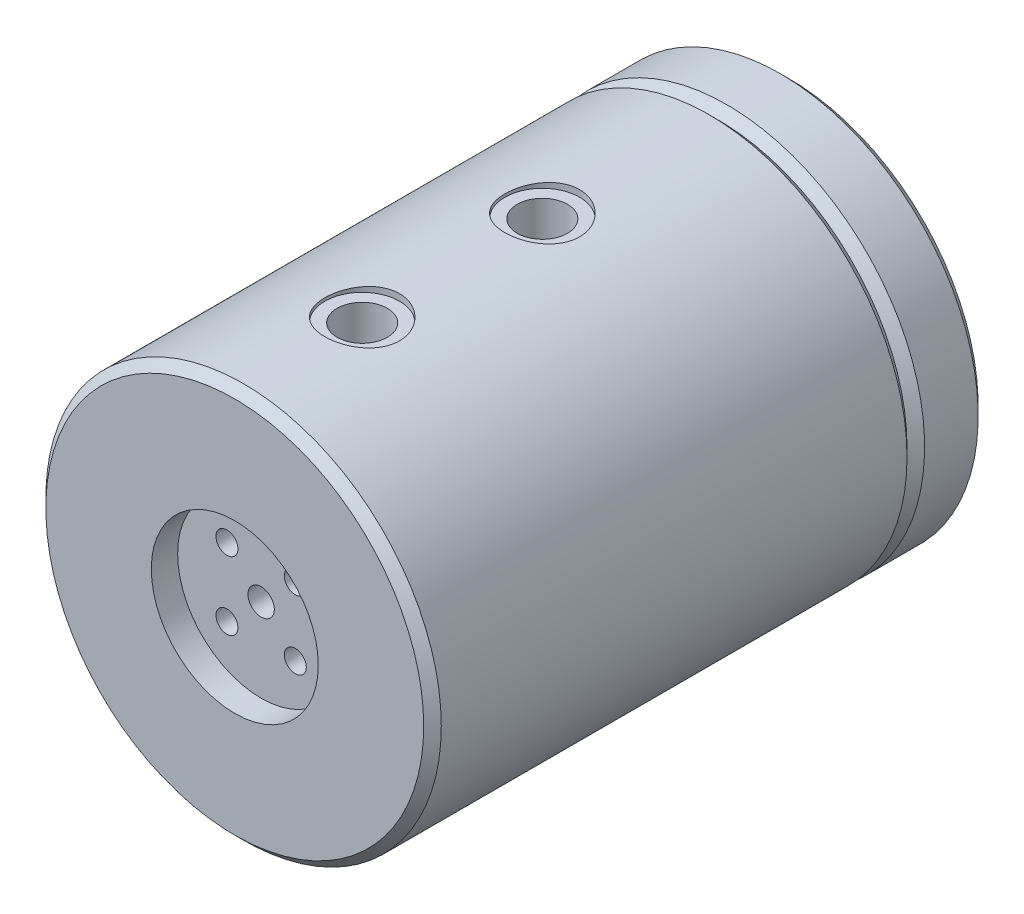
ISO-10303-21;
HEADER;
FILE_DESCRIPTION(('STEP AP214'),'2;1');
FILE_NAME('part.step','',(''),(''),'','','');
FILE_SCHEMA(('AUTOMOTIVE_DESIGN { 1 0 10303 214 1 1 1 1 }'));
ENDSEC;
DATA;
#1=APPLICATION_CONTEXT('core data for automotive mechanical design processes');
#2=APPLICATION_PROTOCOL_DEFINITION('international standard','automotive_design',2000,#1);
#3=PRODUCT_CONTEXT('',#1,'mechanical');
#4=PRODUCT('Part','Part','',(#3));
#5=PRODUCT_RELATED_PRODUCT_CATEGORY('part','',(#4));
#6=PRODUCT_DEFINITION_FORMATION('','',#4);
#7=PRODUCT_DEFINITION_CONTEXT('part definition',#1,'design');
#8=PRODUCT_DEFINITION('design','',#6,#7);
#9=PRODUCT_DEFINITION_SHAPE('','',#8);
#10=(LENGTH_UNIT() NAMED_UNIT(*) SI_UNIT(.MILLI.,.METRE.));
#11=(NAMED_UNIT(*) PLANE_ANGLE_UNIT() SI_UNIT($,.RADIAN.));
#12=(NAMED_UNIT(*) SI_UNIT($,.STERADIAN.) SOLID_ANGLE_UNIT());
#13=UNCERTAINTY_MEASURE_WITH_UNIT(LENGTH_MEASURE(1.E-05),#10,'distance_accuracy_value','');
#14=(GEOMETRIC_REPRESENTATION_CONTEXT(3) GLOBAL_UNCERTAINTY_ASSIGNED_CONTEXT((#13)) GLOBAL_UNIT_ASSIGNED_CONTEXT((#10,
#11,#12)) REPRESENTATION_CONTEXT('',''));
#15=CARTESIAN_POINT('',(0.,0.,0.));
#16=DIRECTION('',(0.,0.,1.));
#17=DIRECTION('',(1.,0.,0.));
#18=AXIS2_PLACEMENT_3D('',#15,#16,#17);
#19=CARTESIAN_POINT('',(0.,0.,110.));
#20=DIRECTION('',(0.,0.,-1.));
#21=DIRECTION('',(-1.,0.,0.));
#22=AXIS2_PLACEMENT_3D('',#19,#20,#21);
#23=CYLINDRICAL_SURFACE('',#22,45.);
#24=CARTESIAN_POINT('',(-45.,0.,75.));
#25=CARTESIAN_POINT('',(-45.0000004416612,-0.140012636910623,75.0000014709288));
#26=CARTESIAN_POINT('',(-44.9993452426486,-0.280003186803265,74.9941167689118));
#27=CARTESIAN_POINT('',(-44.9967436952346,-0.559029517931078,74.9706222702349));
#28=CARTESIAN_POINT('',(-44.9947970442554,-0.69806506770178,74.9530097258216));
#29=CARTESIAN_POINT('',(-44.9896647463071,-0.974249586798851,74.9061668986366));
#30=CARTESIAN_POINT('',(-44.9864781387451,-1.11139700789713,74.8769276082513));
#31=CARTESIAN_POINT('',(-44.9789547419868,-1.38277351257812,74.8070340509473));
#32=CARTESIAN_POINT('',(-44.9746175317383,-1.51700150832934,74.7663756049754));
#33=CARTESIAN_POINT('',(-44.9649206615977,-1.78140258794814,74.6739914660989));
#34=CARTESIAN_POINT('',(-44.9595620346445,-1.91157961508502,74.622276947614));
#35=CARTESIAN_POINT('',(-44.9479679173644,-2.16715277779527,74.5081086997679));
#36=CARTESIAN_POINT('',(-44.9417321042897,-2.2925471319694,74.4456510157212));
#37=CARTESIAN_POINT('',(-44.9285637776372,-2.537558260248,74.3104943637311));
#38=CARTESIAN_POINT('',(-44.9216316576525,-2.65717824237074,74.2378011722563));
#39=CARTESIAN_POINT('',(-44.9072591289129,-2.88992731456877,74.0826327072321));
#40=CARTESIAN_POINT('',(-44.8998185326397,-3.00305398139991,74.0001538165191));
#41=CARTESIAN_POINT('',(-44.8846125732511,-3.2223722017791,73.8257051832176));
#42=CARTESIAN_POINT('',(-44.876846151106,-3.32853771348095,73.7337027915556));
#43=CARTESIAN_POINT('',(-44.8612293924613,-3.5327885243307,73.5410619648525));
#44=CARTESIAN_POINT('',(-44.8533790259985,-3.63087082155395,73.4404203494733));
#45=CARTESIAN_POINT('',(-44.8378213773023,-3.81819424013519,73.2312683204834));
#46=CARTESIAN_POINT('',(-44.8301140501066,-3.9074381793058,73.122760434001));
#47=CARTESIAN_POINT('',(-44.8150551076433,-4.07652366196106,72.8985644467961));
#48=CARTESIAN_POINT('',(-44.8077036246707,-4.1563617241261,72.7828737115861));
#49=CARTESIAN_POINT('',(-44.7935520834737,-4.30620145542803,72.5448860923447));
#50=CARTESIAN_POINT('',(-44.7867533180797,-4.37618032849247,72.4225747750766));
#51=CARTESIAN_POINT('',(-44.7739181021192,-4.50560635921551,72.1724078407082));
#52=CARTESIAN_POINT('',(-44.7678819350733,-4.56504960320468,72.0445501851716));
#53=CARTESIAN_POINT('',(-44.7567511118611,-4.67291975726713,71.784277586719));
#54=CARTESIAN_POINT('',(-44.7516560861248,-4.72135099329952,71.6518644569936));
#55=CARTESIAN_POINT('',(-44.7425487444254,-4.80688608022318,71.3833782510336));
#56=CARTESIAN_POINT('',(-44.7385368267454,-4.84398576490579,71.2473038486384));
#57=CARTESIAN_POINT('',(-44.7283464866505,-4.93752680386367,70.836278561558));
#58=CARTESIAN_POINT('',(-44.7239527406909,-4.97677903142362,70.5571485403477));
#59=CARTESIAN_POINT('',(-44.720479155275,-5.00788936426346,69.9963828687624));
#60=CARTESIAN_POINT('',(-44.721399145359,-4.99974898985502,69.7147472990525));
#61=CARTESIAN_POINT('',(-44.7284216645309,-4.93652582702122,69.1581126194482));
#62=CARTESIAN_POINT('',(-44.734500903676,-4.88165399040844,68.8830893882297));
#63=CARTESIAN_POINT('',(-44.751123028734,-4.72683754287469,68.3461904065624));
#64=CARTESIAN_POINT('',(-44.7616659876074,-4.62689219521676,68.0843148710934));
#65=CARTESIAN_POINT('',(-44.7860536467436,-4.38453987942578,67.5804697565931));
#66=CARTESIAN_POINT('',(-44.7999055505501,-4.24204009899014,67.3385451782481));
#67=CARTESIAN_POINT('',(-44.8293446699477,-3.91868933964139,66.8819656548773));
#68=CARTESIAN_POINT('',(-44.8449319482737,-3.73783697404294,66.6673116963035));
#69=CARTESIAN_POINT('',(-44.8761892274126,-3.34174035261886,66.2701400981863));
#70=CARTESIAN_POINT('',(-44.8918592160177,-3.1263140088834,66.0878040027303));
#71=CARTESIAN_POINT('',(-44.9214364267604,-2.6678145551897,65.761854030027));
#72=CARTESIAN_POINT('',(-44.9353436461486,-2.42474140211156,65.618240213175));
#73=CARTESIAN_POINT('',(-44.9598345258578,-1.91771658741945,65.3738155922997));
#74=CARTESIAN_POINT('',(-44.9704174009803,-1.65376001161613,65.2730148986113));
#75=CARTESIAN_POINT('',(-44.9870596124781,-1.11252438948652,65.117215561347));
#76=CARTESIAN_POINT('',(-44.9931191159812,-0.835245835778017,65.0622152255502));
#77=CARTESIAN_POINT('',(-45.0000102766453,-0.276808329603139,64.9998102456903));
#78=CARTESIAN_POINT('',(-45.000869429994,0.00432232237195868,64.9921552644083));
#79=CARTESIAN_POINT('',(-44.9973370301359,0.563862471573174,65.0239994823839));
#80=CARTESIAN_POINT('',(-44.9929455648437,0.842272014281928,65.0634978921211));
#81=CARTESIAN_POINT('',(-44.9794227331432,1.38773764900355,65.1883198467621));
#82=CARTESIAN_POINT('',(-44.9703035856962,1.65482109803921,65.2735252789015));
#83=CARTESIAN_POINT('',(-44.9483475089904,2.17090567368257,65.4872207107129));
#84=CARTESIAN_POINT('',(-44.9355104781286,2.41990630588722,65.6157118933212));
#85=CARTESIAN_POINT('',(-44.9074839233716,2.89388316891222,65.9129456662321));
#86=CARTESIAN_POINT('',(-44.8922849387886,3.11875635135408,66.0818516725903));
#87=CARTESIAN_POINT('',(-44.8612679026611,3.53704956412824,66.4548884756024));
#88=CARTESIAN_POINT('',(-44.8454498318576,3.73046861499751,66.6590203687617));
#89=CARTESIAN_POINT('',(-44.8148936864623,4.08124064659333,67.0978073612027));
#90=CARTESIAN_POINT('',(-44.8001607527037,4.23842863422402,67.3325947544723));
#91=CARTESIAN_POINT('',(-44.7735244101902,4.51113857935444,67.8253939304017));
#92=CARTESIAN_POINT('',(-44.7616209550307,4.62666122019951,68.0834053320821));
#93=CARTESIAN_POINT('',(-44.7420233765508,4.81249399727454,68.6147241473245));
#94=CARTESIAN_POINT('',(-44.7343203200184,4.88290014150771,68.8879977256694));
#95=CARTESIAN_POINT('',(-44.7239742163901,4.97679248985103,69.4427326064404));
#96=CARTESIAN_POINT('',(-44.7213309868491,5.00028038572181,69.7241936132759));
#97=CARTESIAN_POINT('',(-44.7213742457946,4.99985615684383,70.1452910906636));
#98=CARTESIAN_POINT('',(-44.7220508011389,4.99382441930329,70.2851668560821));
#99=CARTESIAN_POINT('',(-44.7246981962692,4.97006507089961,70.5638951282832));
#100=CARTESIAN_POINT('',(-44.7266685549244,4.95234180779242,70.7027479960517));
#101=CARTESIAN_POINT('',(-44.7318502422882,4.90531586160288,70.978497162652));
#102=CARTESIAN_POINT('',(-44.7350620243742,4.87600894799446,71.115392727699));
#103=CARTESIAN_POINT('',(-44.742632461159,4.80604607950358,71.3861688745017));
#104=CARTESIAN_POINT('',(-44.74699069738,4.76539426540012,71.5200505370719));
#105=CARTESIAN_POINT('',(-44.7567312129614,4.67302531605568,71.7839221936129));
#106=CARTESIAN_POINT('',(-44.7621136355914,4.62130663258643,71.9139116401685));
#107=CARTESIAN_POINT('',(-44.7737470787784,4.50720070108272,72.1690228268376));
#108=CARTESIAN_POINT('',(-44.7799977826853,4.4448173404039,72.2941463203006));
#109=CARTESIAN_POINT('',(-44.7931950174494,4.3097889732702,72.5387480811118));
#110=CARTESIAN_POINT('',(-44.8001417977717,4.23714028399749,72.6582243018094));
#111=CARTESIAN_POINT('',(-44.8145310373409,4.08213929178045,72.8906122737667));
#112=CARTESIAN_POINT('',(-44.8219733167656,3.99979050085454,73.0035263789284));
#113=CARTESIAN_POINT('',(-44.8371898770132,3.82545426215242,73.2226719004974));
#114=CARTESIAN_POINT('',(-44.8449657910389,3.73341516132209,73.3288621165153));
#115=CARTESIAN_POINT('',(-44.8605874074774,3.54076694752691,73.533081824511));
#116=CARTESIAN_POINT('',(-44.8684330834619,3.44016096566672,73.6311142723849));
#117=CARTESIAN_POINT('',(-44.8839804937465,3.23099013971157,73.8184322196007));
#118=CARTESIAN_POINT('',(-44.8916821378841,3.1224205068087,73.907712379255));
#119=CARTESIAN_POINT('',(-44.9067165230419,2.8981772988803,74.0767977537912));
#120=CARTESIAN_POINT('',(-44.9140493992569,2.78250636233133,74.1566064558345));
#121=CARTESIAN_POINT('',(-44.9281666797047,2.54442616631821,74.3064775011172));
#122=CARTESIAN_POINT('',(-44.9349491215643,2.42199520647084,74.3765055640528));
#123=CARTESIAN_POINT('',(-44.9477423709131,2.17167109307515,74.5059619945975));
#124=CARTESIAN_POINT('',(-44.953753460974,2.04377996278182,74.5653942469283));
#125=CARTESIAN_POINT('',(-44.9648314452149,1.78350217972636,74.6732155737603));
#126=CARTESIAN_POINT('',(-44.9698990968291,1.6511192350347,74.7216135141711));
#127=CARTESIAN_POINT('',(-44.9789509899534,1.3827509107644,74.8070606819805));
#128=CARTESIAN_POINT('',(-44.9829354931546,1.24676641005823,74.8441126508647));
#129=CARTESIAN_POINT('',(-44.9908037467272,0.927675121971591,74.9167207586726));
#130=CARTESIAN_POINT('',(-44.9942383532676,0.74354869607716,74.9479195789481));
#131=CARTESIAN_POINT('',(-44.9988361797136,0.372935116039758,74.9895581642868));
#132=CARTESIAN_POINT('',(-44.9999994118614,0.186447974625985,74.9999980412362));
#133=CARTESIAN_POINT('',(-45.,0.,75.));
#134=B_SPLINE_CURVE_WITH_KNOTS('',3,(#24,#25,#26,#27,#28,#29,#30,#31,#32,#33,#34,#35,#36,#37,
#38,#39,#40,#41,#42,#43,#44,#45,#46,#47,#48,#49,#50,#51,#52,#53,#54,#55,#56,#57,#58,#59,#60,#61,
#62,#63,#64,#65,#66,#67,#68,#69,#70,#71,#72,#73,#74,#75,#76,#77,#78,#79,#80,#81,#82,#83,#84,#85,
#86,#87,#88,#89,#90,#91,#92,#93,#94,#95,#96,#97,#98,#99,#100,#101,#102,#103,#104,#105,#106,#107,
#108,#109,#110,#111,#112,#113,#114,#115,#116,#117,#118,#119,#120,#121,#122,#123,#124,#125,#126,
#127,#128,#129,#130,#131,#132,#133),.UNSPECIFIED.,.T.,.F.,(4,2,2,2,2,2,2,2,2,2,2,2,2,2,2,2,2,2,
2,2,2,2,2,2,2,2,2,2,2,2,2,2,2,2,2,2,2,2,2,2,2,2,2,2,2,2,2,2,2,2,2,2,2,2,4),(0.,0.41987481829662,
0.839848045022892,1.26014727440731,1.68060052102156,2.10063080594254,2.5208160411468,
2.94076508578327,3.36086984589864,3.78246578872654,4.20421760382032,4.62583452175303,
5.04760700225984,5.4703392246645,5.89322815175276,6.31595066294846,6.73882840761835,
7.58016735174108,8.4214793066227,9.25901347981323,10.0965613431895,10.9359494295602,
11.7753678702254,12.6193617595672,13.4633569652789,14.3075513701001,15.1517145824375,
15.9914104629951,16.8310922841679,17.66861464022,18.5061598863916,19.347150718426,
20.1881677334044,21.0329421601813,21.8777027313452,22.7206596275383,23.5635861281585,
23.9831999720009,24.4026578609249,24.8222690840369,25.2417273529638,25.6612443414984,
26.0806087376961,26.5001239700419,26.9194877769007,27.3412124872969,27.7627837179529,
28.1846105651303,28.6062816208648,29.0293953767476,29.4523536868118,29.8749709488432,
30.297486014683,30.8566157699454,31.4157425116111),.UNSPECIFIED.);
#135=CARTESIAN_POINT('',(-45.,0.,75.));
#136=VERTEX_POINT('',#135);
#137=EDGE_CURVE('E227',#136,#136,#134,.T.);
#138=ORIENTED_EDGE('',*,*,#137,.T.);
#139=EDGE_LOOP('',(#138));
#140=FACE_BOUND('',#139,.T.);
#141=CARTESIAN_POINT('',(0.,-45.,52.));
#142=CARTESIAN_POINT('',(0.236550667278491,-45.0000020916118,51.9999956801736));
#143=CARTESIAN_POINT('',(0.473045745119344,-44.9981314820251,52.0098773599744));
#144=CARTESIAN_POINT('',(0.944402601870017,-44.9907058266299,52.0493186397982));
#145=CARTESIAN_POINT('',(1.17926408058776,-44.9851501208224,52.0788817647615));
#146=CARTESIAN_POINT('',(1.64571880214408,-44.9705026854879,52.1574828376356));
#147=CARTESIAN_POINT('',(1.87731015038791,-44.9614089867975,52.206531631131));
#148=CARTESIAN_POINT('',(2.33554015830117,-44.9399363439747,52.3237418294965));
#149=CARTESIAN_POINT('',(2.5621769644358,-44.9275561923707,52.3919102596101));
#150=CARTESIAN_POINT('',(3.00852940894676,-44.8998740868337,52.5467314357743));
#151=CARTESIAN_POINT('',(3.22825362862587,-44.8845759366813,52.6333601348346));
#152=CARTESIAN_POINT('',(3.65965810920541,-44.851462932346,52.8245463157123));
#153=CARTESIAN_POINT('',(3.87133532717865,-44.8336471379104,52.9291104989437));
#154=CARTESIAN_POINT('',(4.28501957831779,-44.7960012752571,53.1553313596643));
#155=CARTESIAN_POINT('',(4.48703146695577,-44.7761722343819,53.2769793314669));
#156=CARTESIAN_POINT('',(4.88024011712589,-44.7350238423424,53.536610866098));
#157=CARTESIAN_POINT('',(5.07143189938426,-44.7137038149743,53.6746018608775));
#158=CARTESIAN_POINT('',(5.44364978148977,-44.6699247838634,53.9675141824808));
#159=CARTESIAN_POINT('',(5.6245426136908,-44.6474559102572,54.1226034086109));
#160=CARTESIAN_POINT('',(5.97257916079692,-44.6022318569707,54.4473215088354));
#161=CARTESIAN_POINT('',(6.13972889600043,-44.5794768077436,54.6169439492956));
#162=CARTESIAN_POINT('',(6.45931055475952,-44.5342943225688,54.9697215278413));
#163=CARTESIAN_POINT('',(6.61173532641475,-44.5118670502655,55.1528831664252));
#164=CARTESIAN_POINT('',(6.90066996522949,-44.4679896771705,55.5313568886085));
#165=CARTESIAN_POINT('',(7.0371857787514,-44.4465392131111,55.7266643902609));
#166=CARTESIAN_POINT('',(7.29449104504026,-44.4050395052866,56.1298656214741));
#167=CARTESIAN_POINT('',(7.41513811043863,-44.385003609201,56.3378516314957));
#168=CARTESIAN_POINT('',(7.63841401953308,-44.3471245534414,56.7633783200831));
#169=CARTESIAN_POINT('',(7.74104924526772,-44.3292806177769,56.9809155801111));
#170=CARTESIAN_POINT('',(7.92759068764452,-44.2963010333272,57.4241073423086));
#171=CARTESIAN_POINT('',(8.01149478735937,-44.281165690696,57.6497627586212));
#172=CARTESIAN_POINT('',(8.15990661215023,-44.2540576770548,58.1075493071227));
#173=CARTESIAN_POINT('',(8.22441459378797,-44.2420849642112,58.3396803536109));
#174=CARTESIAN_POINT('',(8.33288089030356,-44.2217831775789,58.8059747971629));
#175=CARTESIAN_POINT('',(8.3770714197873,-44.213413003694,59.0400823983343));
#176=CARTESIAN_POINT('',(8.44565654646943,-44.2003632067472,59.5112804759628));
#177=CARTESIAN_POINT('',(8.47005139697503,-44.1956835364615,59.7483709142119));
#178=CARTESIAN_POINT('',(8.49884794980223,-44.1901550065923,60.223789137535));
#179=CARTESIAN_POINT('',(8.50325119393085,-44.1893058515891,60.4621168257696));
#180=CARTESIAN_POINT('',(8.49203288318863,-44.1914630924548,60.9382818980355));
#181=CARTESIAN_POINT('',(8.47641147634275,-44.1944694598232,61.1761192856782));
#182=CARTESIAN_POINT('',(8.42561849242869,-44.2041808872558,61.6463497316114));
#183=CARTESIAN_POINT('',(8.39071512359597,-44.210835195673,61.8787728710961));
#184=CARTESIAN_POINT('',(8.30180441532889,-44.2276168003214,62.3398901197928));
#185=CARTESIAN_POINT('',(8.2477905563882,-44.2377452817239,62.5685829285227));
#186=CARTESIAN_POINT('',(8.12108482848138,-44.261180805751,63.0205257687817));
#187=CARTESIAN_POINT('',(8.04839593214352,-44.27448734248,63.24377666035));
#188=CARTESIAN_POINT('',(7.88487701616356,-44.3039006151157,63.6833485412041));
#189=CARTESIAN_POINT('',(7.79404635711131,-44.3200074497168,63.8996692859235));
#190=CARTESIAN_POINT('',(7.59430385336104,-44.3546714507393,64.3251960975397));
#191=CARTESIAN_POINT('',(7.48528602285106,-44.3732428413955,64.5343512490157));
#192=CARTESIAN_POINT('',(7.25033769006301,-44.4122367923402,64.9427587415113));
#193=CARTESIAN_POINT('',(7.12440678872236,-44.4326593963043,65.1420108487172));
#194=CARTESIAN_POINT('',(6.85650131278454,-44.4747880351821,65.5292976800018));
#195=CARTESIAN_POINT('',(6.71452551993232,-44.4964941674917,65.7173315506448));
#196=CARTESIAN_POINT('',(6.4155041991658,-44.5405897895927,66.0809238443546));
#197=CARTESIAN_POINT('',(6.25845850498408,-44.5629792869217,66.2564821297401));
#198=CARTESIAN_POINT('',(5.92771669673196,-44.6081883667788,66.596667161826));
#199=CARTESIAN_POINT('',(5.75379405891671,-44.6310090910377,66.7610736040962));
#200=CARTESIAN_POINT('',(5.39266911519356,-44.6760811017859,67.0746717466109));
#201=CARTESIAN_POINT('',(5.20546695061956,-44.6983323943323,67.2238636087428));
#202=CARTESIAN_POINT('',(4.81904963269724,-44.7416422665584,67.505996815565));
#203=CARTESIAN_POINT('',(4.61983399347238,-44.762700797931,67.6389375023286));
#204=CARTESIAN_POINT('',(4.21076910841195,-44.80303176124,67.8876054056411));
#205=CARTESIAN_POINT('',(4.00092019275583,-44.8223042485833,68.0033331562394));
#206=CARTESIAN_POINT('',(3.57171688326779,-44.858547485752,68.2168891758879));
#207=CARTESIAN_POINT('',(3.35234876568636,-44.8755147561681,68.3146904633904));
#208=CARTESIAN_POINT('',(2.90602876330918,-44.9066255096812,68.4914068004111));
#209=CARTESIAN_POINT('',(2.67907964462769,-44.9207700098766,68.5703286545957));
#210=CARTESIAN_POINT('',(2.21912818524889,-44.9458398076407,68.7087241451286));
#211=CARTESIAN_POINT('',(1.98612527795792,-44.9567648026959,68.7681959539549));
#212=CARTESIAN_POINT('',(1.51578605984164,-44.9750794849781,68.8672065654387));
#213=CARTESIAN_POINT('',(1.27844980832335,-44.9824692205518,68.9067456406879));
#214=CARTESIAN_POINT('',(0.804773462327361,-44.9934175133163,68.9651301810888));
#215=CARTESIAN_POINT('',(0.568471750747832,-44.9970318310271,68.9842769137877));
#216=CARTESIAN_POINT('',(0.095067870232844,-45.0005221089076,69.0027685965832));
#217=CARTESIAN_POINT('',(-0.142034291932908,-45.0003981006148,69.0021137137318));
#218=CARTESIAN_POINT('',(-0.615312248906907,-44.9964153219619,68.9810080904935));
#219=CARTESIAN_POINT('',(-0.85148808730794,-44.9925567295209,68.9605582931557));
#220=CARTESIAN_POINT('',(-1.32122135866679,-44.9812135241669,68.9000269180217));
#221=CARTESIAN_POINT('',(-1.55477879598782,-44.973728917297,68.859945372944));
#222=CARTESIAN_POINT('',(-2.01572180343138,-44.9554183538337,68.7608707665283));
#223=CARTESIAN_POINT('',(-2.24314210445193,-44.9446200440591,68.7020340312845));
#224=CARTESIAN_POINT('',(-2.69225992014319,-44.9199547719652,68.5657810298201));
#225=CARTESIAN_POINT('',(-2.91395545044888,-44.9060867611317,68.4883584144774));
#226=CARTESIAN_POINT('',(-3.34999495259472,-44.8756648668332,68.3155311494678));
#227=CARTESIAN_POINT('',(-3.56433991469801,-44.8591113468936,68.2201289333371));
#228=CARTESIAN_POINT('',(-3.98427339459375,-44.8237657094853,68.0120224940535));
#229=CARTESIAN_POINT('',(-4.18986159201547,-44.8049735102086,67.899317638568));
#230=CARTESIAN_POINT('',(-4.59312622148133,-44.7654408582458,67.656063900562));
#231=CARTESIAN_POINT('',(-4.7906901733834,-44.7446811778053,67.5253316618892));
#232=CARTESIAN_POINT('',(-5.17414274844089,-44.7019627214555,67.2479070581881));
#233=CARTESIAN_POINT('',(-5.36003105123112,-44.6800039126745,67.1012142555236));
#234=CARTESIAN_POINT('',(-5.71889964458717,-44.6354891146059,66.7928655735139));
#235=CARTESIAN_POINT('',(-5.89187898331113,-44.6129330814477,66.6312085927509));
#236=CARTESIAN_POINT('',(-6.22375744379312,-44.5678459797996,66.2940316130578));
#237=CARTESIAN_POINT('',(-6.3826564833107,-44.5453149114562,66.1185115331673));
#238=CARTESIAN_POINT('',(-6.68734823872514,-44.5006001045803,65.7523203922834));
#239=CARTESIAN_POINT('',(-6.83293469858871,-44.4784251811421,65.561476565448));
#240=CARTESIAN_POINT('',(-7.10751052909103,-44.4353756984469,65.168065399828));
#241=CARTESIAN_POINT('',(-7.2365000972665,-44.4145011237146,64.9654982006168));
#242=CARTESIAN_POINT('',(-7.47695286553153,-44.3746553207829,64.5500347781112));
#243=CARTESIAN_POINT('',(-7.58841605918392,-44.3556840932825,64.337138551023));
#244=CARTESIAN_POINT('',(-7.7929842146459,-44.3202005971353,63.9025109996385));
#245=CARTESIAN_POINT('',(-7.88608984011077,-44.3036882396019,63.6807799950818));
#246=CARTESIAN_POINT('',(-8.05284140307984,-44.2736817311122,63.2311124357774));
#247=CARTESIAN_POINT('',(-8.12657704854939,-44.2601737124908,63.0032100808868));
#248=CARTESIAN_POINT('',(-8.25456476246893,-44.2364826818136,62.5419184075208));
#249=CARTESIAN_POINT('',(-8.30882405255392,-44.2262984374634,62.3085311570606));
#250=CARTESIAN_POINT('',(-8.39746855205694,-44.2095528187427,61.8378616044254));
#251=CARTESIAN_POINT('',(-8.43185200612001,-44.2029917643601,61.6005789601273));
#252=CARTESIAN_POINT('',(-8.48045791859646,-44.1936924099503,61.1238841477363));
#253=CARTESIAN_POINT('',(-8.49468062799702,-44.1909540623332,60.8844720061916));
#254=CARTESIAN_POINT('',(-8.50278300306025,-44.1893957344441,60.409203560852));
#255=CARTESIAN_POINT('',(-8.49699089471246,-44.1905125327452,60.1733529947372));
#256=CARTESIAN_POINT('',(-8.46582796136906,-44.1964931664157,59.7029137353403));
#257=CARTESIAN_POINT('',(-8.44045032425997,-44.201358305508,59.4683255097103));
#258=CARTESIAN_POINT('',(-8.3703156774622,-44.21469310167,59.0022187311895));
#259=CARTESIAN_POINT('',(-8.32556262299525,-44.2231620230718,58.7706995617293));
#260=CARTESIAN_POINT('',(-8.21702464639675,-44.24345770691,58.3123109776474));
#261=CARTESIAN_POINT('',(-8.15323915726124,-44.2552845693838,58.0854417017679));
#262=CARTESIAN_POINT('',(-8.00726685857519,-44.2819282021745,57.638381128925));
#263=CARTESIAN_POINT('',(-7.92511647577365,-44.296739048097,57.4181775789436));
#264=CARTESIAN_POINT('',(-7.74294971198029,-44.328944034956,56.985482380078));
#265=CARTESIAN_POINT('',(-7.64293300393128,-44.3463382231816,56.7729908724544));
#266=CARTESIAN_POINT('',(-7.42574945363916,-44.3832217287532,56.3571419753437));
#267=CARTESIAN_POINT('',(-7.30858190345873,-44.4027111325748,56.1537849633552));
#268=CARTESIAN_POINT('',(-7.05791830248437,-44.4432435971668,55.7575588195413));
#269=CARTESIAN_POINT('',(-6.92442200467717,-44.4642866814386,55.5646898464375));
#270=CARTESIAN_POINT('',(-6.63986240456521,-44.507676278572,55.187861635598));
#271=CARTESIAN_POINT('',(-6.48856281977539,-44.5300377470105,55.0040825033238));
#272=CARTESIAN_POINT('',(-6.17111800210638,-44.5751387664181,54.6498837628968));
#273=CARTESIAN_POINT('',(-6.00497295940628,-44.5978783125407,54.4794639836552));
#274=CARTESIAN_POINT('',(-5.65891965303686,-44.643107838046,54.1530945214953));
#275=CARTESIAN_POINT('',(-5.4790079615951,-44.6655977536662,53.9971484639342));
#276=CARTESIAN_POINT('',(-5.10667774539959,-44.7096966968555,53.7008495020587));
#277=CARTESIAN_POINT('',(-4.91425950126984,-44.731305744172,53.560496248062));
#278=CARTESIAN_POINT('',(-4.51635207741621,-44.7732392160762,53.2951207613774));
#279=CARTESIAN_POINT('',(-4.31075719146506,-44.7935496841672,53.1702547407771));
#280=CARTESIAN_POINT('',(-3.88965392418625,-44.8320786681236,52.9383632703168));
#281=CARTESIAN_POINT('',(-3.6741492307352,-44.850297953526,52.8313312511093));
#282=CARTESIAN_POINT('',(-3.23480151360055,-44.8841235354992,52.6359162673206));
#283=CARTESIAN_POINT('',(-3.01096390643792,-44.8997314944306,52.5475214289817));
#284=CARTESIAN_POINT('',(-2.55650186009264,-44.9278996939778,52.3899966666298));
#285=CARTESIAN_POINT('',(-2.32587879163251,-44.9404605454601,52.3208628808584));
#286=CARTESIAN_POINT('',(-1.75136093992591,-44.9672011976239,52.1749418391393));
#287=CARTESIAN_POINT('',(-1.40444695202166,-44.9794391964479,52.1094239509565));
#288=CARTESIAN_POINT('',(-0.70498074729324,-44.9958369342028,52.0219568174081));
#289=CARTESIAN_POINT('',(-0.352428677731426,-44.9999968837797,52.0000064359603));
#290=CARTESIAN_POINT('',(0.,-45.,52.));
#291=B_SPLINE_CURVE_WITH_KNOTS('',3,(#141,#142,#143,#144,#145,#146,#147,#148,#149,#150,#151,
#152,#153,#154,#155,#156,#157,#158,#159,#160,#161,#162,#163,#164,#165,#166,#167,#168,#169,#170,
#171,#172,#173,#174,#175,#176,#177,#178,#179,#180,#181,#182,#183,#184,#185,#186,#187,#188,#189,
#190,#191,#192,#193,#194,#195,#196,#197,#198,#199,#200,#201,#202,#203,#204,#205,#206,#207,#208,
#209,#210,#211,#212,#213,#214,#215,#216,#217,#218,#219,#220,#221,#222,#223,#224,#225,#226,#227,
#228,#229,#230,#231,#232,#233,#234,#235,#236,#237,#238,#239,#240,#241,#242,#243,#244,#245,#246,
#247,#248,#249,#250,#251,#252,#253,#254,#255,#256,#257,#258,#259,#260,#261,#262,#263,#264,#265,
#266,#267,#268,#269,#270,#271,#272,#273,#274,#275,#276,#277,#278,#279,#280,#281,#282,#283,#284,
#285,#286,#287,#288,#289,#290),.UNSPECIFIED.,.T.,.F.,(4,2,2,2,2,2,2,2,2,2,2,2,2,2,2,2,2,2,2,2,2,
2,2,2,2,2,2,2,2,2,2,2,2,2,2,2,2,2,2,2,2,2,2,2,2,2,2,2,2,2,2,2,2,2,2,2,2,2,2,2,2,2,2,2,2,2,2,2,2,
2,2,2,2,2,4),(0.,0.709342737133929,1.41881255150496,2.12867780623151,2.83880423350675,
3.54801121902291,4.25748377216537,4.96659608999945,5.67603212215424,6.39318844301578,
7.11002891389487,7.82721582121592,8.54413379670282,9.26709987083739,9.98980926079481,
10.7126002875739,11.4353817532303,12.149683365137,12.8639758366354,13.5782132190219,
14.2924453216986,14.9969840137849,15.7017632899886,16.4064304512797,17.1111224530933,
17.8200744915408,18.5290432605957,19.2380658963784,19.9470963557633,20.6674908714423,
21.3878777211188,22.108293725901,22.8286873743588,23.5501565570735,24.2713653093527,
24.9926418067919,25.7139084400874,26.424364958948,27.1348154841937,27.8452321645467,
28.5556476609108,29.2602901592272,29.9651737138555,30.6699619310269,31.3747759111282,
32.0873753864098,32.799994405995,33.512665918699,34.2253415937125,34.9476531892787,
35.669956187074,36.3922594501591,37.1145365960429,37.8334072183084,38.5520110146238,
39.270678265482,39.9893365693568,40.6962658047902,41.4034410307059,42.1104719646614,
42.8175239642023,43.5231857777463,44.2288605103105,44.9345643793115,45.6402789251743,
46.3567259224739,47.073163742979,47.7897805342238,48.506381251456,49.2297060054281,
49.9527637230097,50.6753593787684,51.3978100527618,52.4546628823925,53.5114881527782),.UNSPECIFIED.);
#292=CARTESIAN_POINT('',(0.,-45.,52.));
#293=VERTEX_POINT('',#292);
#294=EDGE_CURVE('E110',#293,#293,#291,.T.);
#295=ORIENTED_EDGE('',*,*,#294,.F.);
#296=EDGE_LOOP('',(#295));
#297=FACE_BOUND('',#296,.T.);
#298=CARTESIAN_POINT('',(0.,45.,48.5));
#299=CARTESIAN_POINT('',(-0.236550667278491,45.0000020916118,48.5000043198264));
#300=CARTESIAN_POINT('',(-0.473045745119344,44.9981314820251,48.4901226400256));
#301=CARTESIAN_POINT('',(-0.944402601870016,44.9907058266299,48.4506813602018));
#302=CARTESIAN_POINT('',(-1.17926408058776,44.9851501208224,48.4211182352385));
#303=CARTESIAN_POINT('',(-1.64571880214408,44.9705026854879,48.3425171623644));
#304=CARTESIAN_POINT('',(-1.87731015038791,44.9614089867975,48.293468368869));
#305=CARTESIAN_POINT('',(-2.33554015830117,44.9399363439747,48.1762581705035));
#306=CARTESIAN_POINT('',(-2.56217696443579,44.9275561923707,48.1080897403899));
#307=CARTESIAN_POINT('',(-3.00852940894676,44.8998740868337,47.9532685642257));
#308=CARTESIAN_POINT('',(-3.22825362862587,44.8845759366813,47.8666398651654));
#309=CARTESIAN_POINT('',(-3.65965810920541,44.851462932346,47.6754536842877));
#310=CARTESIAN_POINT('',(-3.87133532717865,44.8336471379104,47.5708895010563));
#311=CARTESIAN_POINT('',(-4.28501957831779,44.7960012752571,47.3446686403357));
#312=CARTESIAN_POINT('',(-4.48703146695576,44.7761722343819,47.2230206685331));
#313=CARTESIAN_POINT('',(-4.88024011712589,44.7350238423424,46.963389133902));
#314=CARTESIAN_POINT('',(-5.07143189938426,44.7137038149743,46.8253981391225));
#315=CARTESIAN_POINT('',(-5.44364978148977,44.6699247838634,46.5324858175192));
#316=CARTESIAN_POINT('',(-5.6245426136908,44.6474559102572,46.3773965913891));
#317=CARTESIAN_POINT('',(-5.97257916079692,44.6022318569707,46.0526784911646));
#318=CARTESIAN_POINT('',(-6.13972889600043,44.5794768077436,45.8830560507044));
#319=CARTESIAN_POINT('',(-6.45931055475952,44.5342943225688,45.5302784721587));
#320=CARTESIAN_POINT('',(-6.61173532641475,44.5118670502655,45.3471168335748));
#321=CARTESIAN_POINT('',(-6.90066996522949,44.4679896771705,44.9686431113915));
#322=CARTESIAN_POINT('',(-7.0371857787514,44.4465392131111,44.7733356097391));
#323=CARTESIAN_POINT('',(-7.29449104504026,44.4050395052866,44.3701343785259));
#324=CARTESIAN_POINT('',(-7.41513811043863,44.385003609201,44.1621483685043));
#325=CARTESIAN_POINT('',(-7.63841401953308,44.3471245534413,43.7366216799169));
#326=CARTESIAN_POINT('',(-7.74104924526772,44.3292806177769,43.5190844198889));
#327=CARTESIAN_POINT('',(-7.92759068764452,44.2963010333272,43.0758926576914));
#328=CARTESIAN_POINT('',(-8.01149478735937,44.281165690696,42.8502372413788));
#329=CARTESIAN_POINT('',(-8.15990661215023,44.2540576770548,42.3924506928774));
#330=CARTESIAN_POINT('',(-8.22441459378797,44.2420849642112,42.1603196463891));
#331=CARTESIAN_POINT('',(-8.33288089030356,44.2217831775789,41.6940252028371));
#332=CARTESIAN_POINT('',(-8.3770714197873,44.213413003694,41.4599176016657));
#333=CARTESIAN_POINT('',(-8.44565654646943,44.2003632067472,40.9887195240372));
#334=CARTESIAN_POINT('',(-8.47005139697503,44.1956835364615,40.7516290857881));
#335=CARTESIAN_POINT('',(-8.49884794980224,44.1901550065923,40.276210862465));
#336=CARTESIAN_POINT('',(-8.50325119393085,44.1893058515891,40.0378831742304));
#337=CARTESIAN_POINT('',(-8.49203288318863,44.1914630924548,39.5617181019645));
#338=CARTESIAN_POINT('',(-8.47641147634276,44.1944694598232,39.3238807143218));
#339=CARTESIAN_POINT('',(-8.4256184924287,44.2041808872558,38.8536502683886));
#340=CARTESIAN_POINT('',(-8.39071512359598,44.210835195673,38.6212271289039));
#341=CARTESIAN_POINT('',(-8.30180441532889,44.2276168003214,38.1601098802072));
#342=CARTESIAN_POINT('',(-8.24779055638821,44.2377452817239,37.9314170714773));
#343=CARTESIAN_POINT('',(-8.12108482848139,44.261180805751,37.4794742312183));
#344=CARTESIAN_POINT('',(-8.04839593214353,44.27448734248,37.25622333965));
#345=CARTESIAN_POINT('',(-7.88487701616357,44.3039006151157,36.816651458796));
#346=CARTESIAN_POINT('',(-7.79404635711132,44.3200074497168,36.6003307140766));
#347=CARTESIAN_POINT('',(-7.59430385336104,44.3546714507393,36.1748039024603));
#348=CARTESIAN_POINT('',(-7.48528602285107,44.3732428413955,35.9656487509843));
#349=CARTESIAN_POINT('',(-7.25033769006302,44.4122367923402,35.5572412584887));
#350=CARTESIAN_POINT('',(-7.12440678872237,44.4326593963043,35.3579891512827));
#351=CARTESIAN_POINT('',(-6.85650131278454,44.4747880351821,34.9707023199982));
#352=CARTESIAN_POINT('',(-6.71452551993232,44.4964941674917,34.7826684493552));
#353=CARTESIAN_POINT('',(-6.4155041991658,44.5405897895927,34.4190761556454));
#354=CARTESIAN_POINT('',(-6.25845850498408,44.5629792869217,34.2435178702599));
#355=CARTESIAN_POINT('',(-5.92771669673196,44.6081883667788,33.903332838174));
#356=CARTESIAN_POINT('',(-5.75379405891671,44.6310090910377,33.7389263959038));
#357=CARTESIAN_POINT('',(-5.39266911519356,44.6760811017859,33.4253282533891));
#358=CARTESIAN_POINT('',(-5.20546695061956,44.6983323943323,33.2761363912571));
#359=CARTESIAN_POINT('',(-4.81904963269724,44.7416422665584,32.994003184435));
#360=CARTESIAN_POINT('',(-4.61983399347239,44.762700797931,32.8610624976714));
#361=CARTESIAN_POINT('',(-4.21076910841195,44.80303176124,32.6123945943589));
#362=CARTESIAN_POINT('',(-4.00092019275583,44.8223042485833,32.4966668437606));
#363=CARTESIAN_POINT('',(-3.5717168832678,44.858547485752,32.2831108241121));
#364=CARTESIAN_POINT('',(-3.35234876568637,44.8755147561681,32.1853095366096));
#365=CARTESIAN_POINT('',(-2.90602876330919,44.9066255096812,32.0085931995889));
#366=CARTESIAN_POINT('',(-2.6790796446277,44.9207700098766,31.9296713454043));
#367=CARTESIAN_POINT('',(-2.2191281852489,44.9458398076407,31.7912758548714));
#368=CARTESIAN_POINT('',(-1.98612527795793,44.9567648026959,31.7318040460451));
#369=CARTESIAN_POINT('',(-1.51578605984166,44.9750794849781,31.6327934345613));
#370=CARTESIAN_POINT('',(-1.27844980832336,44.9824692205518,31.5932543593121));
#371=CARTESIAN_POINT('',(-0.80477346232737,44.9934175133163,31.5348698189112));
#372=CARTESIAN_POINT('',(-0.56847175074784,44.9970318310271,31.5157230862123));
#373=CARTESIAN_POINT('',(-0.0950678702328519,45.0005221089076,31.4972314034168));
#374=CARTESIAN_POINT('',(0.1420342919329,45.0003981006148,31.4978862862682));
#375=CARTESIAN_POINT('',(0.615312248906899,44.9964153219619,31.5189919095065));
#376=CARTESIAN_POINT('',(0.851488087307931,44.9925567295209,31.5394417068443));
#377=CARTESIAN_POINT('',(1.32122135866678,44.9812135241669,31.5999730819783));
#378=CARTESIAN_POINT('',(1.55477879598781,44.973728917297,31.640054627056));
#379=CARTESIAN_POINT('',(2.01572180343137,44.9554183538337,31.7391292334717));
#380=CARTESIAN_POINT('',(2.24314210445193,44.9446200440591,31.7979659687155));
#381=CARTESIAN_POINT('',(2.69225992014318,44.9199547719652,31.9342189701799));
#382=CARTESIAN_POINT('',(2.91395545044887,44.9060867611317,32.0116415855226));
#383=CARTESIAN_POINT('',(3.34999495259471,44.8756648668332,32.1844688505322));
#384=CARTESIAN_POINT('',(3.564339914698,44.8591113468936,32.2798710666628));
#385=CARTESIAN_POINT('',(3.98427339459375,44.8237657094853,32.4879775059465));
#386=CARTESIAN_POINT('',(4.18986159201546,44.8049735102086,32.600682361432));
#387=CARTESIAN_POINT('',(4.59312622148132,44.7654408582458,32.8439360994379));
#388=CARTESIAN_POINT('',(4.79069017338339,44.7446811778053,32.9746683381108));
#389=CARTESIAN_POINT('',(5.17414274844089,44.7019627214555,33.2520929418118));
#390=CARTESIAN_POINT('',(5.36003105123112,44.6800039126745,33.3987857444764));
#391=CARTESIAN_POINT('',(5.71889964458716,44.6354891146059,33.7071344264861));
#392=CARTESIAN_POINT('',(5.89187898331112,44.6129330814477,33.8687914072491));
#393=CARTESIAN_POINT('',(6.22375744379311,44.5678459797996,34.2059683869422));
#394=CARTESIAN_POINT('',(6.38265648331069,44.5453149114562,34.3814884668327));
#395=CARTESIAN_POINT('',(6.68734823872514,44.5006001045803,34.7476796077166));
#396=CARTESIAN_POINT('',(6.8329346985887,44.4784251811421,34.938523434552));
#397=CARTESIAN_POINT('',(7.10751052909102,44.4353756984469,35.331934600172));
#398=CARTESIAN_POINT('',(7.23650009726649,44.4145011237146,35.5345017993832));
#399=CARTESIAN_POINT('',(7.47695286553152,44.3746553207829,35.9499652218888));
#400=CARTESIAN_POINT('',(7.58841605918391,44.3556840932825,36.1628614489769));
#401=CARTESIAN_POINT('',(7.79298421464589,44.3202005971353,36.5974890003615));
#402=CARTESIAN_POINT('',(7.88608984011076,44.3036882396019,36.8192200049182));
#403=CARTESIAN_POINT('',(8.05284140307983,44.2736817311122,37.2688875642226));
#404=CARTESIAN_POINT('',(8.12657704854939,44.2601737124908,37.4967899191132));
#405=CARTESIAN_POINT('',(8.25456476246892,44.2364826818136,37.9580815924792));
#406=CARTESIAN_POINT('',(8.30882405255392,44.2262984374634,38.1914688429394));
#407=CARTESIAN_POINT('',(8.39746855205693,44.2095528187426,38.6621383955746));
#408=CARTESIAN_POINT('',(8.43185200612,44.2029917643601,38.8994210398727));
#409=CARTESIAN_POINT('',(8.48045791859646,44.1936924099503,39.3761158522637));
#410=CARTESIAN_POINT('',(8.49468062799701,44.1909540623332,39.6155279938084));
#411=CARTESIAN_POINT('',(8.50278300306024,44.1893957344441,40.090796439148));
#412=CARTESIAN_POINT('',(8.49699089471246,44.1905125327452,40.3266470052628));
#413=CARTESIAN_POINT('',(8.46582796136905,44.1964931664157,40.7970862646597));
#414=CARTESIAN_POINT('',(8.44045032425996,44.201358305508,41.0316744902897));
#415=CARTESIAN_POINT('',(8.3703156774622,44.21469310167,41.4977812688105));
#416=CARTESIAN_POINT('',(8.32556262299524,44.2231620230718,41.7293004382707));
#417=CARTESIAN_POINT('',(8.21702464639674,44.24345770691,42.1876890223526));
#418=CARTESIAN_POINT('',(8.15323915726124,44.2552845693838,42.414558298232));
#419=CARTESIAN_POINT('',(8.00726685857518,44.2819282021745,42.861618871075));
#420=CARTESIAN_POINT('',(7.92511647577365,44.296739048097,43.0818224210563));
#421=CARTESIAN_POINT('',(7.74294971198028,44.328944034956,43.514517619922));
#422=CARTESIAN_POINT('',(7.64293300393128,44.3463382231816,43.7270091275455));
#423=CARTESIAN_POINT('',(7.42574945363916,44.3832217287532,44.1428580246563));
#424=CARTESIAN_POINT('',(7.30858190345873,44.4027111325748,44.3462150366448));
#425=CARTESIAN_POINT('',(7.05791830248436,44.4432435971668,44.7424411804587));
#426=CARTESIAN_POINT('',(6.92442200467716,44.4642866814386,44.9353101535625));
#427=CARTESIAN_POINT('',(6.63986240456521,44.507676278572,45.312138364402));
#428=CARTESIAN_POINT('',(6.48856281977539,44.5300377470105,45.4959174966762));
#429=CARTESIAN_POINT('',(6.17111800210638,44.5751387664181,45.8501162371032));
#430=CARTESIAN_POINT('',(6.00497295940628,44.5978783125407,46.0205360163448));
#431=CARTESIAN_POINT('',(5.65891965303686,44.643107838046,46.3469054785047));
#432=CARTESIAN_POINT('',(5.4790079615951,44.6655977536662,46.5028515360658));
#433=CARTESIAN_POINT('',(5.10667774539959,44.7096966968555,46.7991504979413));
#434=CARTESIAN_POINT('',(4.91425950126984,44.731305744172,46.939503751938));
#435=CARTESIAN_POINT('',(4.51635207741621,44.7732392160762,47.2048792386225));
#436=CARTESIAN_POINT('',(4.31075719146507,44.7935496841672,47.3297452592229));
#437=CARTESIAN_POINT('',(3.88965392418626,44.8320786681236,47.5616367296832));
#438=CARTESIAN_POINT('',(3.6741492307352,44.850297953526,47.6686687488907));
#439=CARTESIAN_POINT('',(3.23480151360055,44.8841235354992,47.8640837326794));
#440=CARTESIAN_POINT('',(3.01096390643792,44.8997314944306,47.9524785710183));
#441=CARTESIAN_POINT('',(2.55650186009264,44.9278996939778,48.1100033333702));
#442=CARTESIAN_POINT('',(2.32587879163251,44.9404605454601,48.1791371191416));
#443=CARTESIAN_POINT('',(1.75136093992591,44.9672011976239,48.3250581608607));
#444=CARTESIAN_POINT('',(1.40444695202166,44.9794391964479,48.3905760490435));
#445=CARTESIAN_POINT('',(0.70498074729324,44.9958369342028,48.4780431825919));
#446=CARTESIAN_POINT('',(0.352428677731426,44.9999968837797,48.4999935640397));
#447=CARTESIAN_POINT('',(0.,45.,48.5));
#448=B_SPLINE_CURVE_WITH_KNOTS('',3,(#298,#299,#300,#301,#302,#303,#304,#305,#306,#307,#308,
#309,#310,#311,#312,#313,#314,#315,#316,#317,#318,#319,#320,#321,#322,#323,#324,#325,#326,#327,
#328,#329,#330,#331,#332,#333,#334,#335,#336,#337,#338,#339,#340,#341,#342,#343,#344,#345,#346,
#347,#348,#349,#350,#351,#352,#353,#354,#355,#356,#357,#358,#359,#360,#361,#362,#363,#364,#365,
#366,#367,#368,#369,#370,#371,#372,#373,#374,#375,#376,#377,#378,#379,#380,#381,#382,#383,#384,
#385,#386,#387,#388,#389,#390,#391,#392,#393,#394,#395,#396,#397,#398,#399,#400,#401,#402,#403,
#404,#405,#406,#407,#408,#409,#410,#411,#412,#413,#414,#415,#416,#417,#418,#419,#420,#421,#422,
#423,#424,#425,#426,#427,#428,#429,#430,#431,#432,#433,#434,#435,#436,#437,#438,#439,#440,#441,
#442,#443,#444,#445,#446,#447),.UNSPECIFIED.,.T.,.F.,(4,2,2,2,2,2,2,2,2,2,2,2,2,2,2,2,2,2,2,2,2,
2,2,2,2,2,2,2,2,2,2,2,2,2,2,2,2,2,2,2,2,2,2,2,2,2,2,2,2,2,2,2,2,2,2,2,2,2,2,2,2,2,2,2,2,2,2,2,2,
2,2,2,2,2,4),(0.,0.709342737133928,1.41881255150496,2.12867780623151,2.83880423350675,
3.54801121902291,4.25748377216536,4.96659608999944,5.67603212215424,6.39318844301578,
7.11002891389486,7.82721582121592,8.54413379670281,9.26709987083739,9.9898092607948,
10.7126002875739,11.4353817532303,12.149683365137,12.8639758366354,13.5782132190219,
14.2924453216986,14.9969840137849,15.7017632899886,16.4064304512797,17.1111224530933,
17.8200744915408,18.5290432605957,19.2380658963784,19.9470963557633,20.6674908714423,
21.3878777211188,22.108293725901,22.8286873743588,23.5501565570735,24.2713653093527,
24.9926418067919,25.7139084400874,26.424364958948,27.1348154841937,27.8452321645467,
28.5556476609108,29.2602901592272,29.9651737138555,30.6699619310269,31.3747759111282,
32.0873753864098,32.799994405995,33.512665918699,34.2253415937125,34.9476531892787,
35.669956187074,36.3922594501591,37.1145365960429,37.8334072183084,38.5520110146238,
39.270678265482,39.9893365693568,40.6962658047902,41.4034410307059,42.1104719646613,
42.8175239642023,43.5231857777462,44.2288605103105,44.9345643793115,45.6402789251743,
46.3567259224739,47.073163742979,47.7897805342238,48.506381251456,49.2297060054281,
49.9527637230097,50.6753593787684,51.3978100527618,52.4546628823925,53.5114881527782),.UNSPECIFIED.);
#449=CARTESIAN_POINT('',(0.,45.,48.5));
#450=VERTEX_POINT('',#449);
#451=EDGE_CURVE('E148',#450,#450,#448,.T.);
#452=ORIENTED_EDGE('',*,*,#451,.T.);
#453=EDGE_LOOP('',(#452));
#454=FACE_BOUND('',#453,.T.);
#455=CARTESIAN_POINT('',(0.,45.,89.5));
#456=CARTESIAN_POINT('',(-0.23655066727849,45.0000020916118,89.5000043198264));
#457=CARTESIAN_POINT('',(-0.473045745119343,44.9981314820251,89.4901226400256));
#458=CARTESIAN_POINT('',(-0.944402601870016,44.9907058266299,89.4506813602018));
#459=CARTESIAN_POINT('',(-1.17926408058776,44.9851501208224,89.4211182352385));
#460=CARTESIAN_POINT('',(-1.64571880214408,44.9705026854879,89.3425171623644));
#461=CARTESIAN_POINT('',(-1.87731015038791,44.9614089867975,89.293468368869));
#462=CARTESIAN_POINT('',(-2.33554015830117,44.9399363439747,89.1762581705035));
#463=CARTESIAN_POINT('',(-2.5621769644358,44.9275561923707,89.1080897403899));
#464=CARTESIAN_POINT('',(-3.00852940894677,44.8998740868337,88.9532685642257));
#465=CARTESIAN_POINT('',(-3.22825362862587,44.8845759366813,88.8666398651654));
#466=CARTESIAN_POINT('',(-3.65965810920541,44.851462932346,88.6754536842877));
#467=CARTESIAN_POINT('',(-3.87133532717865,44.8336471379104,88.5708895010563));
#468=CARTESIAN_POINT('',(-4.28501957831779,44.7960012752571,88.3446686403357));
#469=CARTESIAN_POINT('',(-4.48703146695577,44.7761722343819,88.2230206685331));
#470=CARTESIAN_POINT('',(-4.88024011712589,44.7350238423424,87.963389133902));
#471=CARTESIAN_POINT('',(-5.07143189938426,44.7137038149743,87.8253981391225));
#472=CARTESIAN_POINT('',(-5.44364978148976,44.6699247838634,87.5324858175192));
#473=CARTESIAN_POINT('',(-5.6245426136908,44.6474559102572,87.3773965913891));
#474=CARTESIAN_POINT('',(-5.97257916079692,44.6022318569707,87.0526784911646));
#475=CARTESIAN_POINT('',(-6.13972889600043,44.5794768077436,86.8830560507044));
#476=CARTESIAN_POINT('',(-6.45931055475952,44.5342943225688,86.5302784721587));
#477=CARTESIAN_POINT('',(-6.61173532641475,44.5118670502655,86.3471168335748));
#478=CARTESIAN_POINT('',(-6.90066996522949,44.4679896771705,85.9686431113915));
#479=CARTESIAN_POINT('',(-7.03718577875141,44.4465392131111,85.7733356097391));
#480=CARTESIAN_POINT('',(-7.29449104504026,44.4050395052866,85.3701343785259));
#481=CARTESIAN_POINT('',(-7.41513811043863,44.385003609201,85.1621483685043));
#482=CARTESIAN_POINT('',(-7.63841401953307,44.3471245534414,84.736621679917));
#483=CARTESIAN_POINT('',(-7.74104924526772,44.3292806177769,84.5190844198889));
#484=CARTESIAN_POINT('',(-7.92759068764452,44.2963010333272,84.0758926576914));
#485=CARTESIAN_POINT('',(-8.01149478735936,44.281165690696,83.8502372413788));
#486=CARTESIAN_POINT('',(-8.15990661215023,44.2540576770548,83.3924506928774));
#487=CARTESIAN_POINT('',(-8.22441459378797,44.2420849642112,83.1603196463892));
#488=CARTESIAN_POINT('',(-8.33288089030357,44.2217831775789,82.6940252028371));
#489=CARTESIAN_POINT('',(-8.3770714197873,44.213413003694,82.4599176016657));
#490=CARTESIAN_POINT('',(-8.44565654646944,44.2003632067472,81.9887195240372));
#491=CARTESIAN_POINT('',(-8.47005139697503,44.1956835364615,81.7516290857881));
#492=CARTESIAN_POINT('',(-8.49884794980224,44.1901550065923,81.276210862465));
#493=CARTESIAN_POINT('',(-8.50325119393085,44.1893058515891,81.0378831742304));
#494=CARTESIAN_POINT('',(-8.49203288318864,44.1914630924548,80.5617181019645));
#495=CARTESIAN_POINT('',(-8.47641147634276,44.1944694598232,80.3238807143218));
#496=CARTESIAN_POINT('',(-8.4256184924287,44.2041808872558,79.8536502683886));
#497=CARTESIAN_POINT('',(-8.39071512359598,44.210835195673,79.6212271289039));
#498=CARTESIAN_POINT('',(-8.30180441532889,44.2276168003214,79.1601098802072));
#499=CARTESIAN_POINT('',(-8.24779055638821,44.2377452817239,78.9314170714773));
#500=CARTESIAN_POINT('',(-8.12108482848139,44.261180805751,78.4794742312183));
#501=CARTESIAN_POINT('',(-8.04839593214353,44.27448734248,78.25622333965));
#502=CARTESIAN_POINT('',(-7.88487701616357,44.3039006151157,77.816651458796));
#503=CARTESIAN_POINT('',(-7.79404635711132,44.3200074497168,77.6003307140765));
#504=CARTESIAN_POINT('',(-7.59430385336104,44.3546714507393,77.1748039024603));
#505=CARTESIAN_POINT('',(-7.48528602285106,44.3732428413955,76.9656487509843));
#506=CARTESIAN_POINT('',(-7.25033769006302,44.4122367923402,76.5572412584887));
#507=CARTESIAN_POINT('',(-7.12440678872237,44.4326593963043,76.3579891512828));
#508=CARTESIAN_POINT('',(-6.85650131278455,44.4747880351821,75.9707023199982));
#509=CARTESIAN_POINT('',(-6.71452551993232,44.4964941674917,75.7826684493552));
#510=CARTESIAN_POINT('',(-6.4155041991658,44.5405897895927,75.4190761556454));
#511=CARTESIAN_POINT('',(-6.25845850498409,44.5629792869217,75.2435178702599));
#512=CARTESIAN_POINT('',(-5.92771669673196,44.6081883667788,74.903332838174));
#513=CARTESIAN_POINT('',(-5.75379405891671,44.6310090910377,74.7389263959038));
#514=CARTESIAN_POINT('',(-5.39266911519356,44.6760811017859,74.4253282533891));
#515=CARTESIAN_POINT('',(-5.20546695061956,44.6983323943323,74.2761363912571));
#516=CARTESIAN_POINT('',(-4.81904963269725,44.7416422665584,73.994003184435));
#517=CARTESIAN_POINT('',(-4.61983399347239,44.762700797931,73.8610624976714));
#518=CARTESIAN_POINT('',(-4.21076910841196,44.80303176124,73.6123945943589));
#519=CARTESIAN_POINT('',(-4.00092019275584,44.8223042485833,73.4966668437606));
#520=CARTESIAN_POINT('',(-3.5717168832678,44.858547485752,73.2831108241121));
#521=CARTESIAN_POINT('',(-3.35234876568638,44.8755147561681,73.1853095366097));
#522=CARTESIAN_POINT('',(-2.9060287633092,44.9066255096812,73.0085931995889));
#523=CARTESIAN_POINT('',(-2.67907964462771,44.9207700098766,72.9296713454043));
#524=CARTESIAN_POINT('',(-2.21912818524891,44.9458398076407,72.7912758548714));
#525=CARTESIAN_POINT('',(-1.98612527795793,44.9567648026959,72.7318040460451));
#526=CARTESIAN_POINT('',(-1.51578605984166,44.9750794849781,72.6327934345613));
#527=CARTESIAN_POINT('',(-1.27844980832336,44.9824692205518,72.5932543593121));
#528=CARTESIAN_POINT('',(-0.804773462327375,44.9934175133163,72.5348698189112));
#529=CARTESIAN_POINT('',(-0.568471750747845,44.9970318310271,72.5157230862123));
#530=CARTESIAN_POINT('',(-0.0950678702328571,45.0005221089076,72.4972314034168));
#531=CARTESIAN_POINT('',(0.142034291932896,45.0003981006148,72.4978862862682));
#532=CARTESIAN_POINT('',(0.615312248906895,44.9964153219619,72.5189919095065));
#533=CARTESIAN_POINT('',(0.851488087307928,44.9925567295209,72.5394417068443));
#534=CARTESIAN_POINT('',(1.32122135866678,44.9812135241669,72.5999730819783));
#535=CARTESIAN_POINT('',(1.55477879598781,44.973728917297,72.640054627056));
#536=CARTESIAN_POINT('',(2.01572180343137,44.9554183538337,72.7391292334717));
#537=CARTESIAN_POINT('',(2.24314210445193,44.9446200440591,72.7979659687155));
#538=CARTESIAN_POINT('',(2.69225992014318,44.9199547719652,72.9342189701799));
#539=CARTESIAN_POINT('',(2.91395545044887,44.9060867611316,73.0116415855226));
#540=CARTESIAN_POINT('',(3.34999495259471,44.8756648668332,73.1844688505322));
#541=CARTESIAN_POINT('',(3.564339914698,44.8591113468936,73.2798710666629));
#542=CARTESIAN_POINT('',(3.98427339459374,44.8237657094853,73.4879775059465));
#543=CARTESIAN_POINT('',(4.18986159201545,44.8049735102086,73.600682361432));
#544=CARTESIAN_POINT('',(4.59312622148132,44.7654408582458,73.8439360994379));
#545=CARTESIAN_POINT('',(4.79069017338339,44.7446811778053,73.9746683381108));
#546=CARTESIAN_POINT('',(5.17414274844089,44.7019627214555,74.2520929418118));
#547=CARTESIAN_POINT('',(5.36003105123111,44.6800039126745,74.3987857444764));
#548=CARTESIAN_POINT('',(5.71889964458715,44.6354891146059,74.7071344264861));
#549=CARTESIAN_POINT('',(5.89187898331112,44.6129330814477,74.8687914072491));
#550=CARTESIAN_POINT('',(6.22375744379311,44.5678459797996,75.2059683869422));
#551=CARTESIAN_POINT('',(6.38265648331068,44.5453149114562,75.3814884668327));
#552=CARTESIAN_POINT('',(6.68734823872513,44.5006001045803,75.7476796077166));
#553=CARTESIAN_POINT('',(6.8329346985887,44.4784251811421,75.938523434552));
#554=CARTESIAN_POINT('',(7.10751052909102,44.4353756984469,76.331934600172));
#555=CARTESIAN_POINT('',(7.2365000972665,44.4145011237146,76.5345017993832));
#556=CARTESIAN_POINT('',(7.47695286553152,44.3746553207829,76.9499652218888));
#557=CARTESIAN_POINT('',(7.58841605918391,44.3556840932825,77.162861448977));
#558=CARTESIAN_POINT('',(7.79298421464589,44.3202005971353,77.5974890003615));
#559=CARTESIAN_POINT('',(7.88608984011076,44.3036882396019,77.8192200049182));
#560=CARTESIAN_POINT('',(8.05284140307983,44.2736817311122,78.2688875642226));
#561=CARTESIAN_POINT('',(8.12657704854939,44.2601737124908,78.4967899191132));
#562=CARTESIAN_POINT('',(8.25456476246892,44.2364826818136,78.9580815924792));
#563=CARTESIAN_POINT('',(8.30882405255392,44.2262984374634,79.1914688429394));
#564=CARTESIAN_POINT('',(8.39746855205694,44.2095528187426,79.6621383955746));
#565=CARTESIAN_POINT('',(8.43185200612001,44.2029917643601,79.8994210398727));
#566=CARTESIAN_POINT('',(8.48045791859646,44.1936924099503,80.3761158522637));
#567=CARTESIAN_POINT('',(8.49468062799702,44.1909540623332,80.6155279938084));
#568=CARTESIAN_POINT('',(8.50278300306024,44.1893957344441,81.090796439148));
#569=CARTESIAN_POINT('',(8.49699089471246,44.1905125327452,81.3266470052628));
#570=CARTESIAN_POINT('',(8.46582796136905,44.1964931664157,81.7970862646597));
#571=CARTESIAN_POINT('',(8.44045032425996,44.201358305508,82.0316744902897));
#572=CARTESIAN_POINT('',(8.3703156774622,44.21469310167,82.4977812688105));
#573=CARTESIAN_POINT('',(8.32556262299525,44.2231620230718,82.7293004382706));
#574=CARTESIAN_POINT('',(8.21702464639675,44.24345770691,83.1876890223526));
#575=CARTESIAN_POINT('',(8.15323915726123,44.2552845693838,83.4145582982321));
#576=CARTESIAN_POINT('',(8.00726685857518,44.2819282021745,83.861618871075));
#577=CARTESIAN_POINT('',(7.92511647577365,44.296739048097,84.0818224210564));
#578=CARTESIAN_POINT('',(7.74294971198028,44.328944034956,84.514517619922));
#579=CARTESIAN_POINT('',(7.64293300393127,44.3463382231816,84.7270091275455));
#580=CARTESIAN_POINT('',(7.42574945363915,44.3832217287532,85.1428580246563));
#581=CARTESIAN_POINT('',(7.30858190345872,44.4027111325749,85.3462150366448));
#582=CARTESIAN_POINT('',(7.05791830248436,44.4432435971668,85.7424411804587));
#583=CARTESIAN_POINT('',(6.92442200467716,44.4642866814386,85.9353101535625));
#584=CARTESIAN_POINT('',(6.63986240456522,44.507676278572,86.312138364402));
#585=CARTESIAN_POINT('',(6.4885628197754,44.5300377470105,86.4959174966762));
#586=CARTESIAN_POINT('',(6.17111800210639,44.5751387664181,86.8501162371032));
#587=CARTESIAN_POINT('',(6.00497295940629,44.5978783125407,87.0205360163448));
#588=CARTESIAN_POINT('',(5.65891965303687,44.643107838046,87.3469054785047));
#589=CARTESIAN_POINT('',(5.4790079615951,44.6655977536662,87.5028515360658));
#590=CARTESIAN_POINT('',(5.10667774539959,44.7096966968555,87.7991504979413));
#591=CARTESIAN_POINT('',(4.91425950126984,44.731305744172,87.939503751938));
#592=CARTESIAN_POINT('',(4.51635207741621,44.7732392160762,88.2048792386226));
#593=CARTESIAN_POINT('',(4.31075719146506,44.7935496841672,88.3297452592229));
#594=CARTESIAN_POINT('',(3.88965392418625,44.8320786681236,88.5616367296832));
#595=CARTESIAN_POINT('',(3.6741492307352,44.850297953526,88.6686687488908));
#596=CARTESIAN_POINT('',(3.23480151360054,44.8841235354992,88.8640837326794));
#597=CARTESIAN_POINT('',(3.01096390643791,44.8997314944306,88.9524785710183));
#598=CARTESIAN_POINT('',(2.55650186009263,44.9278996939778,89.1100033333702));
#599=CARTESIAN_POINT('',(2.3258787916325,44.9404605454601,89.1791371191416));
#600=CARTESIAN_POINT('',(1.75136093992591,44.9672011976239,89.3250581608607));
#601=CARTESIAN_POINT('',(1.40444695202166,44.9794391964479,89.3905760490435));
#602=CARTESIAN_POINT('',(0.704980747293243,44.9958369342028,89.4780431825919));
#603=CARTESIAN_POINT('',(0.352428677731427,44.9999968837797,89.4999935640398));
#604=CARTESIAN_POINT('',(0.,45.,89.5));
#605=B_SPLINE_CURVE_WITH_KNOTS('',3,(#455,#456,#457,#458,#459,#460,#461,#462,#463,#464,#465,
#466,#467,#468,#469,#470,#471,#472,#473,#474,#475,#476,#477,#478,#479,#480,#481,#482,#483,#484,
#485,#486,#487,#488,#489,#490,#491,#492,#493,#494,#495,#496,#497,#498,#499,#500,#501,#502,#503,
#504,#505,#506,#507,#508,#509,#510,#511,#512,#513,#514,#515,#516,#517,#518,#519,#520,#521,#522,
#523,#524,#525,#526,#527,#528,#529,#530,#531,#532,#533,#534,#535,#536,#537,#538,#539,#540,#541,
#542,#543,#544,#545,#546,#547,#548,#549,#550,#551,#552,#553,#554,#555,#556,#557,#558,#559,#560,
#561,#562,#563,#564,#565,#566,#567,#568,#569,#570,#571,#572,#573,#574,#575,#576,#577,#578,#579,
#580,#581,#582,#583,#584,#585,#586,#587,#588,#589,#590,#591,#592,#593,#594,#595,#596,#597,#598,
#599,#600,#601,#602,#603,#604),.UNSPECIFIED.,.T.,.F.,(4,2,2,2,2,2,2,2,2,2,2,2,2,2,2,2,2,2,2,2,2,
2,2,2,2,2,2,2,2,2,2,2,2,2,2,2,2,2,2,2,2,2,2,2,2,2,2,2,2,2,2,2,2,2,2,2,2,2,2,2,2,2,2,2,2,2,2,2,2,
2,2,2,2,2,4),(0.,0.709342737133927,1.41881255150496,2.12867780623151,2.83880423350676,
3.54801121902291,4.25748377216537,4.96659608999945,5.67603212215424,6.39318844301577,
7.11002891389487,7.82721582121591,8.54413379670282,9.26709987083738,9.98980926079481,
10.7126002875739,11.4353817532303,12.149683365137,12.8639758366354,13.5782132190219,
14.2924453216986,14.9969840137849,15.7017632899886,16.4064304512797,17.1111224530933,
17.8200744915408,18.5290432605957,19.2380658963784,19.9470963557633,20.6674908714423,
21.3878777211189,22.108293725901,22.8286873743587,23.5501565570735,24.2713653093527,
24.9926418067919,25.7139084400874,26.424364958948,27.1348154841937,27.8452321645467,
28.5556476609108,29.2602901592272,29.9651737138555,30.6699619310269,31.3747759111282,
32.0873753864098,32.799994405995,33.512665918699,34.2253415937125,34.9476531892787,
35.669956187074,36.3922594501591,37.1145365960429,37.8334072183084,38.5520110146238,
39.2706782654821,39.9893365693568,40.6962658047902,41.4034410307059,42.1104719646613,
42.8175239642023,43.5231857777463,44.2288605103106,44.9345643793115,45.6402789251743,
46.3567259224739,47.073163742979,47.7897805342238,48.506381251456,49.2297060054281,
49.9527637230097,50.6753593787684,51.3978100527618,52.4546628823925,53.5114881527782),.UNSPECIFIED.);
#606=CARTESIAN_POINT('',(0.,45.,89.5));
#607=VERTEX_POINT('',#606);
#608=EDGE_CURVE('E139',#607,#607,#605,.T.);
#609=ORIENTED_EDGE('',*,*,#608,.T.);
#610=EDGE_LOOP('',(#609));
#611=FACE_BOUND('',#610,.T.);
#612=CARTESIAN_POINT('',(0.,0.,2.00000000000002));
#613=DIRECTION('',(0.,0.,1.));
#614=DIRECTION('',(1.,0.,0.));
#615=AXIS2_PLACEMENT_3D('',#612,#613,#614);
#616=CIRCLE('',#615,45.);
#617=CARTESIAN_POINT('',(45.,0.,2.00000000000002));
#618=VERTEX_POINT('',#617);
#619=EDGE_CURVE('E133',#618,#618,#616,.T.);
#620=ORIENTED_EDGE('',*,*,#619,.T.);
#621=EDGE_LOOP('',(#620));
#622=FACE_BOUND('',#621,.T.);
#623=CARTESIAN_POINT('',(0.,0.,108.));
#624=DIRECTION('',(0.,0.,1.));
#625=DIRECTION('',(1.,0.,0.));
#626=AXIS2_PLACEMENT_3D('',#623,#624,#625);
#627=CIRCLE('',#626,45.);
#628=CARTESIAN_POINT('',(45.,0.,108.));
#629=VERTEX_POINT('',#628);
#630=EDGE_CURVE('E130',#629,#629,#627,.F.);
#631=ORIENTED_EDGE('',*,*,#630,.T.);
#632=EDGE_LOOP('',(#631));
#633=FACE_BOUND('',#632,.T.);
#634=CARTESIAN_POINT('',(0.,-45.,11.));
#635=CARTESIAN_POINT('',(0.236550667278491,-45.0000020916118,10.9999956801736));
#636=CARTESIAN_POINT('',(0.473045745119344,-44.9981314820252,11.0098773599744));
#637=CARTESIAN_POINT('',(0.944402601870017,-44.9907058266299,11.0493186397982));
#638=CARTESIAN_POINT('',(1.17926408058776,-44.9851501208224,11.0788817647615));
#639=CARTESIAN_POINT('',(1.64571880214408,-44.9705026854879,11.1574828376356));
#640=CARTESIAN_POINT('',(1.87731015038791,-44.9614089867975,11.206531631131));
#641=CARTESIAN_POINT('',(2.33554015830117,-44.9399363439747,11.3237418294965));
#642=CARTESIAN_POINT('',(2.5621769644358,-44.9275561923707,11.3919102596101));
#643=CARTESIAN_POINT('',(3.00852940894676,-44.8998740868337,11.5467314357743));
#644=CARTESIAN_POINT('',(3.22825362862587,-44.8845759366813,11.6333601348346));
#645=CARTESIAN_POINT('',(3.65965810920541,-44.851462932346,11.8245463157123));
#646=CARTESIAN_POINT('',(3.87133532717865,-44.8336471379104,11.9291104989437));
#647=CARTESIAN_POINT('',(4.28501957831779,-44.7960012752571,12.1553313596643));
#648=CARTESIAN_POINT('',(4.48703146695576,-44.7761722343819,12.2769793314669));
#649=CARTESIAN_POINT('',(4.88024011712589,-44.7350238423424,12.536610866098));
#650=CARTESIAN_POINT('',(5.07143189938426,-44.7137038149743,12.6746018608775));
#651=CARTESIAN_POINT('',(5.44364978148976,-44.6699247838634,12.9675141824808));
#652=CARTESIAN_POINT('',(5.62454261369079,-44.6474559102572,13.1226034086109));
#653=CARTESIAN_POINT('',(5.97257916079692,-44.6022318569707,13.4473215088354));
#654=CARTESIAN_POINT('',(6.13972889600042,-44.5794768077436,13.6169439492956));
#655=CARTESIAN_POINT('',(6.45931055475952,-44.5342943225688,13.9697215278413));
#656=CARTESIAN_POINT('',(6.61173532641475,-44.5118670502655,14.1528831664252));
#657=CARTESIAN_POINT('',(6.90066996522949,-44.4679896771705,14.5313568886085));
#658=CARTESIAN_POINT('',(7.0371857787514,-44.4465392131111,14.7266643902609));
#659=CARTESIAN_POINT('',(7.29449104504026,-44.4050395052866,15.1298656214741));
#660=CARTESIAN_POINT('',(7.41513811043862,-44.385003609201,15.3378516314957));
#661=CARTESIAN_POINT('',(7.63841401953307,-44.3471245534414,15.7633783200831));
#662=CARTESIAN_POINT('',(7.74104924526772,-44.3292806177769,15.9809155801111));
#663=CARTESIAN_POINT('',(7.92759068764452,-44.2963010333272,16.4241073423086));
#664=CARTESIAN_POINT('',(8.01149478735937,-44.281165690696,16.6497627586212));
#665=CARTESIAN_POINT('',(8.15990661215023,-44.2540576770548,17.1075493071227));
#666=CARTESIAN_POINT('',(8.22441459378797,-44.2420849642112,17.3396803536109));
#667=CARTESIAN_POINT('',(8.33288089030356,-44.2217831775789,17.8059747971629));
#668=CARTESIAN_POINT('',(8.3770714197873,-44.213413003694,18.0400823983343));
#669=CARTESIAN_POINT('',(8.44565654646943,-44.2003632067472,18.5112804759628));
#670=CARTESIAN_POINT('',(8.47005139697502,-44.1956835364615,18.7483709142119));
#671=CARTESIAN_POINT('',(8.49884794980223,-44.1901550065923,19.223789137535));
#672=CARTESIAN_POINT('',(8.50325119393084,-44.1893058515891,19.4621168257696));
#673=CARTESIAN_POINT('',(8.49203288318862,-44.1914630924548,19.9382818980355));
#674=CARTESIAN_POINT('',(8.47641147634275,-44.1944694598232,20.1761192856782));
#675=CARTESIAN_POINT('',(8.42561849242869,-44.2041808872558,20.6463497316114));
#676=CARTESIAN_POINT('',(8.39071512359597,-44.210835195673,20.8787728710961));
#677=CARTESIAN_POINT('',(8.30180441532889,-44.2276168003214,21.3398901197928));
#678=CARTESIAN_POINT('',(8.2477905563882,-44.2377452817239,21.5685829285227));
#679=CARTESIAN_POINT('',(8.12108482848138,-44.261180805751,22.0205257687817));
#680=CARTESIAN_POINT('',(8.04839593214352,-44.27448734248,22.24377666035));
#681=CARTESIAN_POINT('',(7.88487701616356,-44.3039006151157,22.6833485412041));
#682=CARTESIAN_POINT('',(7.79404635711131,-44.3200074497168,22.8996692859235));
#683=CARTESIAN_POINT('',(7.59430385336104,-44.3546714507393,23.3251960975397));
#684=CARTESIAN_POINT('',(7.48528602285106,-44.3732428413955,23.5343512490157));
#685=CARTESIAN_POINT('',(7.25033769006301,-44.4122367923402,23.9427587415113));
#686=CARTESIAN_POINT('',(7.12440678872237,-44.4326593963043,24.1420108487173));
#687=CARTESIAN_POINT('',(6.85650131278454,-44.4747880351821,24.5292976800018));
#688=CARTESIAN_POINT('',(6.71452551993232,-44.4964941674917,24.7173315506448));
#689=CARTESIAN_POINT('',(6.41550419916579,-44.5405897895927,25.0809238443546));
#690=CARTESIAN_POINT('',(6.25845850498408,-44.5629792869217,25.2564821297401));
#691=CARTESIAN_POINT('',(5.92771669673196,-44.6081883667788,25.596667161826));
#692=CARTESIAN_POINT('',(5.7537940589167,-44.6310090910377,25.7610736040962));
#693=CARTESIAN_POINT('',(5.39266911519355,-44.6760811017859,26.0746717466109));
#694=CARTESIAN_POINT('',(5.20546695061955,-44.6983323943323,26.2238636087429));
#695=CARTESIAN_POINT('',(4.81904963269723,-44.7416422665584,26.505996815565));
#696=CARTESIAN_POINT('',(4.61983399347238,-44.762700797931,26.6389375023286));
#697=CARTESIAN_POINT('',(4.21076910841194,-44.80303176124,26.8876054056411));
#698=CARTESIAN_POINT('',(4.00092019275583,-44.8223042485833,27.0033331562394));
#699=CARTESIAN_POINT('',(3.57171688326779,-44.858547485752,27.2168891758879));
#700=CARTESIAN_POINT('',(3.35234876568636,-44.8755147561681,27.3146904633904));
#701=CARTESIAN_POINT('',(2.90602876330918,-44.9066255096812,27.4914068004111));
#702=CARTESIAN_POINT('',(2.6790796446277,-44.9207700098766,27.5703286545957));
#703=CARTESIAN_POINT('',(2.21912818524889,-44.9458398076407,27.7087241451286));
#704=CARTESIAN_POINT('',(1.98612527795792,-44.9567648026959,27.7681959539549));
#705=CARTESIAN_POINT('',(1.51578605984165,-44.9750794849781,27.8672065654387));
#706=CARTESIAN_POINT('',(1.27844980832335,-44.9824692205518,27.9067456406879));
#707=CARTESIAN_POINT('',(0.804773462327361,-44.9934175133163,27.9651301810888));
#708=CARTESIAN_POINT('',(0.56847175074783,-44.9970318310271,27.9842769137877));
#709=CARTESIAN_POINT('',(0.0950678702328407,-45.0005221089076,28.0027685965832));
#710=CARTESIAN_POINT('',(-0.142034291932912,-45.0003981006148,28.0021137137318));
#711=CARTESIAN_POINT('',(-0.615312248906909,-44.9964153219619,27.9810080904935));
#712=CARTESIAN_POINT('',(-0.851488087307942,-44.9925567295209,27.9605582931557));
#713=CARTESIAN_POINT('',(-1.32122135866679,-44.9812135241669,27.9000269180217));
#714=CARTESIAN_POINT('',(-1.55477879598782,-44.973728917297,27.859945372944));
#715=CARTESIAN_POINT('',(-2.01572180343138,-44.9554183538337,27.7608707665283));
#716=CARTESIAN_POINT('',(-2.24314210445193,-44.9446200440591,27.7020340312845));
#717=CARTESIAN_POINT('',(-2.69225992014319,-44.9199547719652,27.5657810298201));
#718=CARTESIAN_POINT('',(-2.91395545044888,-44.9060867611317,27.4883584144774));
#719=CARTESIAN_POINT('',(-3.34999495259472,-44.8756648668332,27.3155311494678));
#720=CARTESIAN_POINT('',(-3.56433991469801,-44.8591113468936,27.2201289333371));
#721=CARTESIAN_POINT('',(-3.98427339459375,-44.8237657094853,27.0120224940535));
#722=CARTESIAN_POINT('',(-4.18986159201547,-44.8049735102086,26.8993176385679));
#723=CARTESIAN_POINT('',(-4.59312622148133,-44.7654408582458,26.656063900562));
#724=CARTESIAN_POINT('',(-4.7906901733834,-44.7446811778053,26.5253316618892));
#725=CARTESIAN_POINT('',(-5.17414274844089,-44.7019627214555,26.2479070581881));
#726=CARTESIAN_POINT('',(-5.36003105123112,-44.6800039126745,26.1012142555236));
#727=CARTESIAN_POINT('',(-5.71889964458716,-44.6354891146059,25.7928655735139));
#728=CARTESIAN_POINT('',(-5.89187898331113,-44.6129330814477,25.6312085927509));
#729=CARTESIAN_POINT('',(-6.22375744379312,-44.5678459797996,25.2940316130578));
#730=CARTESIAN_POINT('',(-6.38265648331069,-44.5453149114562,25.1185115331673));
#731=CARTESIAN_POINT('',(-6.68734823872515,-44.5006001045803,24.7523203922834));
#732=CARTESIAN_POINT('',(-6.83293469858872,-44.4784251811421,24.561476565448));
#733=CARTESIAN_POINT('',(-7.10751052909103,-44.4353756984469,24.168065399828));
#734=CARTESIAN_POINT('',(-7.23650009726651,-44.4145011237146,23.9654982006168));
#735=CARTESIAN_POINT('',(-7.47695286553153,-44.3746553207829,23.5500347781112));
#736=CARTESIAN_POINT('',(-7.58841605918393,-44.3556840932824,23.337138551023));
#737=CARTESIAN_POINT('',(-7.7929842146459,-44.3202005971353,22.9025109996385));
#738=CARTESIAN_POINT('',(-7.88608984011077,-44.3036882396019,22.6807799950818));
#739=CARTESIAN_POINT('',(-8.05284140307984,-44.2736817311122,22.2311124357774));
#740=CARTESIAN_POINT('',(-8.12657704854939,-44.2601737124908,22.0032100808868));
#741=CARTESIAN_POINT('',(-8.25456476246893,-44.2364826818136,21.5419184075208));
#742=CARTESIAN_POINT('',(-8.30882405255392,-44.2262984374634,21.3085311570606));
#743=CARTESIAN_POINT('',(-8.39746855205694,-44.2095528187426,20.8378616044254));
#744=CARTESIAN_POINT('',(-8.43185200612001,-44.2029917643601,20.6005789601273));
#745=CARTESIAN_POINT('',(-8.48045791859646,-44.1936924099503,20.1238841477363));
#746=CARTESIAN_POINT('',(-8.49468062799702,-44.1909540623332,19.8844720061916));
#747=CARTESIAN_POINT('',(-8.50278300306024,-44.1893957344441,19.409203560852));
#748=CARTESIAN_POINT('',(-8.49699089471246,-44.1905125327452,19.1733529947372));
#749=CARTESIAN_POINT('',(-8.46582796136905,-44.1964931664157,18.7029137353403));
#750=CARTESIAN_POINT('',(-8.44045032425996,-44.201358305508,18.4683255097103));
#751=CARTESIAN_POINT('',(-8.3703156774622,-44.21469310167,18.0022187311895));
#752=CARTESIAN_POINT('',(-8.32556262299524,-44.2231620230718,17.7706995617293));
#753=CARTESIAN_POINT('',(-8.21702464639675,-44.24345770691,17.3123109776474));
#754=CARTESIAN_POINT('',(-8.15323915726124,-44.2552845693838,17.0854417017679));
#755=CARTESIAN_POINT('',(-8.00726685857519,-44.2819282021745,16.638381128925));
#756=CARTESIAN_POINT('',(-7.92511647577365,-44.296739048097,16.4181775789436));
#757=CARTESIAN_POINT('',(-7.74294971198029,-44.328944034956,15.985482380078));
#758=CARTESIAN_POINT('',(-7.64293300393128,-44.3463382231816,15.7729908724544));
#759=CARTESIAN_POINT('',(-7.42574945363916,-44.3832217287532,15.3571419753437));
#760=CARTESIAN_POINT('',(-7.30858190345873,-44.4027111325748,15.1537849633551));
#761=CARTESIAN_POINT('',(-7.05791830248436,-44.4432435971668,14.7575588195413));
#762=CARTESIAN_POINT('',(-6.92442200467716,-44.4642866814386,14.5646898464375));
#763=CARTESIAN_POINT('',(-6.63986240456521,-44.507676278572,14.187861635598));
#764=CARTESIAN_POINT('',(-6.48856281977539,-44.5300377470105,14.0040825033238));
#765=CARTESIAN_POINT('',(-6.17111800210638,-44.5751387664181,13.6498837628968));
#766=CARTESIAN_POINT('',(-6.00497295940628,-44.5978783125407,13.4794639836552));
#767=CARTESIAN_POINT('',(-5.65891965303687,-44.643107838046,13.1530945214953));
#768=CARTESIAN_POINT('',(-5.4790079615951,-44.6655977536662,12.9971484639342));
#769=CARTESIAN_POINT('',(-5.10667774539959,-44.7096966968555,12.7008495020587));
#770=CARTESIAN_POINT('',(-4.91425950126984,-44.731305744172,12.560496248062));
#771=CARTESIAN_POINT('',(-4.51635207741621,-44.7732392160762,12.2951207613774));
#772=CARTESIAN_POINT('',(-4.31075719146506,-44.7935496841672,12.170254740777));
#773=CARTESIAN_POINT('',(-3.88965392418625,-44.8320786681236,11.9383632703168));
#774=CARTESIAN_POINT('',(-3.6741492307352,-44.850297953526,11.8313312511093));
#775=CARTESIAN_POINT('',(-3.23480151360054,-44.8841235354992,11.6359162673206));
#776=CARTESIAN_POINT('',(-3.01096390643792,-44.8997314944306,11.5475214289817));
#777=CARTESIAN_POINT('',(-2.55650186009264,-44.9278996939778,11.3899966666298));
#778=CARTESIAN_POINT('',(-2.32587879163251,-44.9404605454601,11.3208628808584));
#779=CARTESIAN_POINT('',(-1.7513609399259,-44.9672011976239,11.1749418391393));
#780=CARTESIAN_POINT('',(-1.40444695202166,-44.9794391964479,11.1094239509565));
#781=CARTESIAN_POINT('',(-0.704980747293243,-44.9958369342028,11.0219568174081));
#782=CARTESIAN_POINT('',(-0.352428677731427,-44.9999968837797,11.0000064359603));
#783=CARTESIAN_POINT('',(0.,-45.,11.));
#784=B_SPLINE_CURVE_WITH_KNOTS('',3,(#634,#635,#636,#637,#638,#639,#640,#641,#642,#643,#644,
#645,#646,#647,#648,#649,#650,#651,#652,#653,#654,#655,#656,#657,#658,#659,#660,#661,#662,#663,
#664,#665,#666,#667,#668,#669,#670,#671,#672,#673,#674,#675,#676,#677,#678,#679,#680,#681,#682,
#683,#684,#685,#686,#687,#688,#689,#690,#691,#692,#693,#694,#695,#696,#697,#698,#699,#700,#701,
#702,#703,#704,#705,#706,#707,#708,#709,#710,#711,#712,#713,#714,#715,#716,#717,#718,#719,#720,
#721,#722,#723,#724,#725,#726,#727,#728,#729,#730,#731,#732,#733,#734,#735,#736,#737,#738,#739,
#740,#741,#742,#743,#744,#745,#746,#747,#748,#749,#750,#751,#752,#753,#754,#755,#756,#757,#758,
#759,#760,#761,#762,#763,#764,#765,#766,#767,#768,#769,#770,#771,#772,#773,#774,#775,#776,#777,
#778,#779,#780,#781,#782,#783),.UNSPECIFIED.,.T.,.F.,(4,2,2,2,2,2,2,2,2,2,2,2,2,2,2,2,2,2,2,2,2,
2,2,2,2,2,2,2,2,2,2,2,2,2,2,2,2,2,2,2,2,2,2,2,2,2,2,2,2,2,2,2,2,2,2,2,2,2,2,2,2,2,2,2,2,2,2,2,2,
2,2,2,2,2,4),(0.,0.709342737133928,1.41881255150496,2.12867780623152,2.83880423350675,
3.54801121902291,4.25748377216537,4.96659608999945,5.67603212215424,6.39318844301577,
7.11002891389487,7.82721582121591,8.54413379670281,9.26709987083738,9.9898092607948,
10.7126002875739,11.4353817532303,12.149683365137,12.8639758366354,13.5782132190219,
14.2924453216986,14.9969840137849,15.7017632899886,16.4064304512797,17.1111224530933,
17.8200744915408,18.5290432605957,19.2380658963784,19.9470963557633,20.6674908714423,
21.3878777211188,22.108293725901,22.8286873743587,23.5501565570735,24.2713653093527,
24.9926418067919,25.7139084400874,26.424364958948,27.1348154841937,27.8452321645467,
28.5556476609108,29.2602901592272,29.9651737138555,30.6699619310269,31.3747759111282,
32.0873753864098,32.799994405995,33.512665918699,34.2253415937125,34.9476531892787,
35.669956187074,36.3922594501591,37.1145365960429,37.8334072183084,38.5520110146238,
39.270678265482,39.9893365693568,40.6962658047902,41.4034410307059,42.1104719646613,
42.8175239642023,43.5231857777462,44.2288605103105,44.9345643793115,45.6402789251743,
46.3567259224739,47.073163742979,47.7897805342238,48.506381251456,49.2297060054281,
49.9527637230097,50.6753593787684,51.3978100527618,52.4546628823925,53.5114881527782),.UNSPECIFIED.);
#785=CARTESIAN_POINT('',(0.,-45.,11.));
#786=VERTEX_POINT('',#785);
#787=EDGE_CURVE('E105',#786,#786,#784,.T.);
#788=ORIENTED_EDGE('',*,*,#787,.F.);
#789=EDGE_LOOP('',(#788));
#790=FACE_BOUND('',#789,.T.);
#791=ADVANCED_FACE('F35',(#140,#297,#454,#611,#622,#633,#790),#23,.T.);
#792=CARTESIAN_POINT('',(0.,0.,110.));
#793=DIRECTION('',(0.,0.,1.));
#794=DIRECTION('',(1.,0.,0.));
#795=AXIS2_PLACEMENT_3D('',#792,#793,#794);
#796=PLANE('',#795);
#797=CARTESIAN_POINT('',(0.,0.,110.));
#798=DIRECTION('',(0.,0.,1.));
#799=DIRECTION('',(1.,0.,0.));
#800=AXIS2_PLACEMENT_3D('',#797,#798,#799);
#801=CIRCLE('',#800,19.);
#802=CARTESIAN_POINT('',(19.,0.,110.));
#803=VERTEX_POINT('',#802);
#804=EDGE_CURVE('E88',#803,#803,#801,.T.);
#805=ORIENTED_EDGE('',*,*,#804,.F.);
#806=EDGE_LOOP('',(#805));
#807=FACE_BOUND('',#806,.T.);
#808=CARTESIAN_POINT('',(0.,0.,110.));
#809=DIRECTION('',(0.,0.,1.));
#810=DIRECTION('',(1.,0.,0.));
#811=AXIS2_PLACEMENT_3D('',#808,#809,#810);
#812=CIRCLE('',#811,43.);
#813=CARTESIAN_POINT('',(43.,0.,110.));
#814=VERTEX_POINT('',#813);
#815=EDGE_CURVE('E127',#814,#814,#812,.T.);
#816=ORIENTED_EDGE('',*,*,#815,.T.);
#817=EDGE_LOOP('',(#816));
#818=FACE_BOUND('',#817,.T.);
#819=ADVANCED_FACE('F178',(#807,#818),#796,.T.);
#820=CARTESIAN_POINT('',(0.,0.,110.));
#821=DIRECTION('',(0.,0.,-1.));
#822=DIRECTION('',(-1.,0.,0.));
#823=AXIS2_PLACEMENT_3D('',#820,#821,#822);
#824=CONICAL_SURFACE('',#823,43.,0.785398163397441);
#825=ORIENTED_EDGE('',*,*,#630,.F.);
#826=EDGE_LOOP('',(#825));
#827=FACE_BOUND('',#826,.T.);
#828=ORIENTED_EDGE('',*,*,#815,.F.);
#829=EDGE_LOOP('',(#828));
#830=FACE_BOUND('',#829,.T.);
#831=ADVANCED_FACE('F180',(#827,#830),#824,.T.);
#832=CARTESIAN_POINT('',(0.,0.,2.00000000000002));
#833=DIRECTION('',(0.,0.,1.));
#834=DIRECTION('',(1.,0.,0.));
#835=AXIS2_PLACEMENT_3D('',#832,#833,#834);
#836=CONICAL_SURFACE('',#835,45.,0.785398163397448);
#837=CARTESIAN_POINT('',(0.,0.,0.));
#838=DIRECTION('',(0.,0.,1.));
#839=DIRECTION('',(1.,0.,0.));
#840=AXIS2_PLACEMENT_3D('',#837,#838,#839);
#841=CIRCLE('',#840,43.);
#842=CARTESIAN_POINT('',(43.,0.,0.));
#843=VERTEX_POINT('',#842);
#844=EDGE_CURVE('E136',#843,#843,#841,.F.);
#845=ORIENTED_EDGE('',*,*,#844,.F.);
#846=EDGE_LOOP('',(#845));
#847=FACE_BOUND('',#846,.T.);
#848=ORIENTED_EDGE('',*,*,#619,.F.);
#849=EDGE_LOOP('',(#848));
#850=FACE_BOUND('',#849,.T.);
#851=ADVANCED_FACE('F159',(#847,#850),#836,.T.);
#852=CARTESIAN_POINT('',(0.,43.5,81.));
#853=DIRECTION('',(0.,1.,0.));
#854=DIRECTION('',(0.,0.,1.));
#855=AXIS2_PLACEMENT_3D('',#852,#853,#854);
#856=CYLINDRICAL_SURFACE('',#855,8.5);
#857=CARTESIAN_POINT('',(0.,43.5,81.));
#858=DIRECTION('',(0.,1.,0.));
#859=DIRECTION('',(0.,0.,1.));
#860=AXIS2_PLACEMENT_3D('',#857,#858,#859);
#861=CIRCLE('',#860,8.5);
#862=CARTESIAN_POINT('',(0.,43.5,89.5));
#863=VERTEX_POINT('',#862);
#864=EDGE_CURVE('E117',#863,#863,#861,.T.);
#865=ORIENTED_EDGE('',*,*,#864,.F.);
#866=EDGE_LOOP('',(#865));
#867=FACE_BOUND('',#866,.T.);
#868=ORIENTED_EDGE('',*,*,#608,.F.);
#869=EDGE_LOOP('',(#868));
#870=FACE_BOUND('',#869,.T.);
#871=ADVANCED_FACE('F153',(#867,#870),#856,.F.);
#872=CARTESIAN_POINT('',(0.,43.5,81.));
#873=DIRECTION('',(0.,1.,0.));
#874=DIRECTION('',(0.,0.,1.));
#875=AXIS2_PLACEMENT_3D('',#872,#873,#874);
#876=PLANE('',#875);
#877=ORIENTED_EDGE('',*,*,#864,.T.);
#878=EDGE_LOOP('',(#877));
#879=FACE_BOUND('',#878,.T.);
#880=CARTESIAN_POINT('',(0.,43.5,81.));
#881=DIRECTION('',(0.,1.,0.));
#882=DIRECTION('',(0.,0.,1.));
#883=AXIS2_PLACEMENT_3D('',#880,#881,#882);
#884=CIRCLE('',#883,5.72249999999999);
#885=CARTESIAN_POINT('',(0.,43.5,86.7225));
#886=VERTEX_POINT('',#885);
#887=EDGE_CURVE('E120',#886,#886,#884,.F.);
#888=ORIENTED_EDGE('',*,*,#887,.T.);
#889=EDGE_LOOP('',(#888));
#890=FACE_BOUND('',#889,.T.);
#891=ADVANCED_FACE('F158',(#879,#890),#876,.T.);
#892=CARTESIAN_POINT('',(0.,25.99,81.));
#893=DIRECTION('',(0.,1.,0.));
#894=DIRECTION('',(0.,0.,1.));
#895=AXIS2_PLACEMENT_3D('',#892,#893,#894);
#896=CONICAL_SURFACE('',#895,5.72249999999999,1.02974425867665);
#897=CARTESIAN_POINT('',(0.,22.5515751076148,81.));
#898=VERTEX_POINT('',#897);
#899=VERTEX_LOOP('',#898);
#900=FACE_BOUND('',#899,.T.);
#901=CARTESIAN_POINT('',(0.,25.99,81.));
#902=DIRECTION('',(0.,1.,0.));
#903=DIRECTION('',(0.,0.,1.));
#904=AXIS2_PLACEMENT_3D('',#901,#902,#903);
#905=CIRCLE('',#904,5.72249999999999);
#906=CARTESIAN_POINT('',(0.,25.99,86.7225));
#907=VERTEX_POINT('',#906);
#908=EDGE_CURVE('E124',#907,#907,#905,.T.);
#909=ORIENTED_EDGE('',*,*,#908,.T.);
#910=EDGE_LOOP('',(#909));
#911=FACE_BOUND('',#910,.T.);
#912=ADVANCED_FACE('F175',(#900,#911),#896,.F.);
#913=CARTESIAN_POINT('',(0.,45.,81.));
#914=DIRECTION('',(0.,1.,0.));
#915=DIRECTION('',(0.,0.,1.));
#916=AXIS2_PLACEMENT_3D('',#913,#914,#915);
#917=CYLINDRICAL_SURFACE('',#916,5.72249999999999);
#918=ORIENTED_EDGE('',*,*,#908,.F.);
#919=EDGE_LOOP('',(#918));
#920=FACE_BOUND('',#919,.T.);
#921=ORIENTED_EDGE('',*,*,#887,.F.);
#922=EDGE_LOOP('',(#921));
#923=FACE_BOUND('',#922,.T.);
#924=ADVANCED_FACE('F171',(#920,#923),#917,.F.);
#925=CARTESIAN_POINT('',(0.,43.5,40.));
#926=DIRECTION('',(0.,1.,0.));
#927=DIRECTION('',(0.,0.,1.));
#928=AXIS2_PLACEMENT_3D('',#925,#926,#927);
#929=CYLINDRICAL_SURFACE('',#928,8.5);
#930=CARTESIAN_POINT('',(0.,43.5,40.));
#931=DIRECTION('',(0.,1.,0.));
#932=DIRECTION('',(0.,0.,1.));
#933=AXIS2_PLACEMENT_3D('',#930,#931,#932);
#934=CIRCLE('',#933,8.5);
#935=CARTESIAN_POINT('',(0.,43.5,48.5));
#936=VERTEX_POINT('',#935);
#937=EDGE_CURVE('E113',#936,#936,#934,.T.);
#938=ORIENTED_EDGE('',*,*,#937,.F.);
#939=EDGE_LOOP('',(#938));
#940=FACE_BOUND('',#939,.T.);
#941=ORIENTED_EDGE('',*,*,#451,.F.);
#942=EDGE_LOOP('',(#941));
#943=FACE_BOUND('',#942,.T.);
#944=ADVANCED_FACE('F174',(#940,#943),#929,.F.);
#945=CARTESIAN_POINT('',(0.,43.5,40.));
#946=DIRECTION('',(0.,1.,0.));
#947=DIRECTION('',(0.,0.,1.));
#948=AXIS2_PLACEMENT_3D('',#945,#946,#947);
#949=PLANE('',#948);
#950=ORIENTED_EDGE('',*,*,#937,.T.);
#951=EDGE_LOOP('',(#950));
#952=FACE_BOUND('',#951,.T.);
#953=CARTESIAN_POINT('',(0.,43.5,40.));
#954=DIRECTION('',(0.,1.,0.));
#955=DIRECTION('',(0.,0.,1.));
#956=AXIS2_PLACEMENT_3D('',#953,#954,#955);
#957=CIRCLE('',#956,5.72249999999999);
#958=CARTESIAN_POINT('',(0.,43.5,45.7225));
#959=VERTEX_POINT('',#958);
#960=EDGE_CURVE('E116',#959,#959,#957,.F.);
#961=ORIENTED_EDGE('',*,*,#960,.T.);
#962=EDGE_LOOP('',(#961));
#963=FACE_BOUND('',#962,.T.);
#964=ADVANCED_FACE('F170',(#952,#963),#949,.T.);
#965=CARTESIAN_POINT('',(0.,25.99,40.));
#966=DIRECTION('',(0.,1.,0.));
#967=DIRECTION('',(0.,0.,1.));
#968=AXIS2_PLACEMENT_3D('',#965,#966,#967);
#969=CONICAL_SURFACE('',#968,5.72249999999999,1.02974425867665);
#970=CARTESIAN_POINT('',(0.,22.5515751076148,40.));
#971=VERTEX_POINT('',#970);
#972=VERTEX_LOOP('',#971);
#973=FACE_BOUND('',#972,.T.);
#974=CARTESIAN_POINT('',(0.,25.99,40.));
#975=DIRECTION('',(0.,1.,0.));
#976=DIRECTION('',(0.,0.,1.));
#977=AXIS2_PLACEMENT_3D('',#974,#975,#976);
#978=CIRCLE('',#977,5.72249999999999);
#979=CARTESIAN_POINT('',(0.,25.99,45.7225));
#980=VERTEX_POINT('',#979);
#981=EDGE_CURVE('E121',#980,#980,#978,.T.);
#982=ORIENTED_EDGE('',*,*,#981,.T.);
#983=EDGE_LOOP('',(#982));
#984=FACE_BOUND('',#983,.T.);
#985=ADVANCED_FACE('F166',(#973,#984),#969,.F.);
#986=CARTESIAN_POINT('',(0.,45.,40.));
#987=DIRECTION('',(0.,1.,0.));
#988=DIRECTION('',(0.,0.,1.));
#989=AXIS2_PLACEMENT_3D('',#986,#987,#988);
#990=CYLINDRICAL_SURFACE('',#989,5.72249999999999);
#991=ORIENTED_EDGE('',*,*,#981,.F.);
#992=EDGE_LOOP('',(#991));
#993=FACE_BOUND('',#992,.T.);
#994=ORIENTED_EDGE('',*,*,#960,.F.);
#995=EDGE_LOOP('',(#994));
#996=FACE_BOUND('',#995,.T.);
#997=ADVANCED_FACE('F162',(#993,#996),#990,.F.);
#998=CARTESIAN_POINT('',(0.,-43.5,60.5));
#999=DIRECTION('',(0.,-1.,0.));
#1000=DIRECTION('',(0.,0.,-1.));
#1001=AXIS2_PLACEMENT_3D('',#998,#999,#1000);
#1002=CYLINDRICAL_SURFACE('',#1001,8.5);
#1003=CARTESIAN_POINT('',(0.,-43.5,60.5));
#1004=DIRECTION('',(0.,1.,0.));
#1005=DIRECTION('',(0.,0.,1.));
#1006=AXIS2_PLACEMENT_3D('',#1003,#1004,#1005);
#1007=CIRCLE('',#1006,8.5);
#1008=CARTESIAN_POINT('',(0.,-43.5,69.));
#1009=VERTEX_POINT('',#1008);
#1010=EDGE_CURVE('E101',#1009,#1009,#1007,.T.);
#1011=ORIENTED_EDGE('',*,*,#1010,.T.);
#1012=EDGE_LOOP('',(#1011));
#1013=FACE_BOUND('',#1012,.T.);
#1014=ORIENTED_EDGE('',*,*,#294,.T.);
#1015=EDGE_LOOP('',(#1014));
#1016=FACE_BOUND('',#1015,.T.);
#1017=ADVANCED_FACE('F165',(#1013,#1016),#1002,.F.);
#1018=CARTESIAN_POINT('',(0.,-43.5,60.5));
#1019=DIRECTION('',(0.,1.,0.));
#1020=DIRECTION('',(0.,0.,1.));
#1021=AXIS2_PLACEMENT_3D('',#1018,#1019,#1020);
#1022=PLANE('',#1021);
#1023=ORIENTED_EDGE('',*,*,#1010,.F.);
#1024=EDGE_LOOP('',(#1023));
#1025=FACE_BOUND('',#1024,.T.);
#1026=CARTESIAN_POINT('',(0.,-43.5,60.5));
#1027=DIRECTION('',(0.,1.,0.));
#1028=DIRECTION('',(0.,0.,1.));
#1029=AXIS2_PLACEMENT_3D('',#1026,#1027,#1028);
#1030=CIRCLE('',#1029,5.72249999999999);
#1031=CARTESIAN_POINT('',(0.,-43.5,66.2225));
#1032=VERTEX_POINT('',#1031);
#1033=EDGE_CURVE('E104',#1032,#1032,#1030,.F.);
#1034=ORIENTED_EDGE('',*,*,#1033,.F.);
#1035=EDGE_LOOP('',(#1034));
#1036=FACE_BOUND('',#1035,.T.);
#1037=ADVANCED_FACE('F278',(#1025,#1036),#1022,.F.);
#1038=CARTESIAN_POINT('',(0.,-25.99,60.5));
#1039=DIRECTION('',(0.,-1.,0.));
#1040=DIRECTION('',(0.,0.,-1.));
#1041=AXIS2_PLACEMENT_3D('',#1038,#1039,#1040);
#1042=CONICAL_SURFACE('',#1041,5.72249999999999,1.02974425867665);
#1043=CARTESIAN_POINT('',(0.,-22.5515751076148,60.5));
#1044=VERTEX_POINT('',#1043);
#1045=VERTEX_LOOP('',#1044);
#1046=FACE_BOUND('',#1045,.T.);
#1047=CARTESIAN_POINT('',(0.,-25.99,60.5));
#1048=DIRECTION('',(0.,-1.,0.));
#1049=DIRECTION('',(0.,0.,-1.));
#1050=AXIS2_PLACEMENT_3D('',#1047,#1048,#1049);
#1051=CIRCLE('',#1050,5.72249999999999);
#1052=CARTESIAN_POINT('',(0.,-25.99,54.7775));
#1053=VERTEX_POINT('',#1052);
#1054=EDGE_CURVE('E109',#1053,#1053,#1051,.T.);
#1055=ORIENTED_EDGE('',*,*,#1054,.T.);
#1056=EDGE_LOOP('',(#1055));
#1057=FACE_BOUND('',#1056,.T.);
#1058=ADVANCED_FACE('F291',(#1046,#1057),#1042,.F.);
#1059=CARTESIAN_POINT('',(0.,-45.,60.5));
#1060=DIRECTION('',(0.,-1.,0.));
#1061=DIRECTION('',(0.,0.,-1.));
#1062=AXIS2_PLACEMENT_3D('',#1059,#1060,#1061);
#1063=CYLINDRICAL_SURFACE('',#1062,5.72249999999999);
#1064=ORIENTED_EDGE('',*,*,#1033,.T.);
#1065=EDGE_LOOP('',(#1064));
#1066=FACE_BOUND('',#1065,.T.);
#1067=ORIENTED_EDGE('',*,*,#1054,.F.);
#1068=EDGE_LOOP('',(#1067));
#1069=FACE_BOUND('',#1068,.T.);
#1070=ADVANCED_FACE('F287',(#1066,#1069),#1063,.F.);
#1071=CARTESIAN_POINT('',(0.,-43.5,19.5));
#1072=DIRECTION('',(0.,-1.,0.));
#1073=DIRECTION('',(0.,0.,-1.));
#1074=AXIS2_PLACEMENT_3D('',#1071,#1072,#1073);
#1075=CYLINDRICAL_SURFACE('',#1074,8.5);
#1076=CARTESIAN_POINT('',(0.,-43.5,19.5));
#1077=DIRECTION('',(0.,1.,0.));
#1078=DIRECTION('',(0.,0.,1.));
#1079=AXIS2_PLACEMENT_3D('',#1076,#1077,#1078);
#1080=CIRCLE('',#1079,8.5);
#1081=CARTESIAN_POINT('',(0.,-43.5,28.));
#1082=VERTEX_POINT('',#1081);
#1083=EDGE_CURVE('E97',#1082,#1082,#1080,.T.);
#1084=ORIENTED_EDGE('',*,*,#1083,.T.);
#1085=EDGE_LOOP('',(#1084));
#1086=FACE_BOUND('',#1085,.T.);
#1087=ORIENTED_EDGE('',*,*,#787,.T.);
#1088=EDGE_LOOP('',(#1087));
#1089=FACE_BOUND('',#1088,.T.);
#1090=ADVANCED_FACE('F290',(#1086,#1089),#1075,.F.);
#1091=CARTESIAN_POINT('',(0.,-43.5,19.5));
#1092=DIRECTION('',(0.,1.,0.));
#1093=DIRECTION('',(0.,0.,1.));
#1094=AXIS2_PLACEMENT_3D('',#1091,#1092,#1093);
#1095=PLANE('',#1094);
#1096=ORIENTED_EDGE('',*,*,#1083,.F.);
#1097=EDGE_LOOP('',(#1096));
#1098=FACE_BOUND('',#1097,.T.);
#1099=CARTESIAN_POINT('',(0.,-43.5,19.5));
#1100=DIRECTION('',(0.,1.,0.));
#1101=DIRECTION('',(0.,0.,1.));
#1102=AXIS2_PLACEMENT_3D('',#1099,#1100,#1101);
#1103=CIRCLE('',#1102,5.72249999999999);
#1104=CARTESIAN_POINT('',(0.,-43.5,25.2225));
#1105=VERTEX_POINT('',#1104);
#1106=EDGE_CURVE('E100',#1105,#1105,#1103,.F.);
#1107=ORIENTED_EDGE('',*,*,#1106,.F.);
#1108=EDGE_LOOP('',(#1107));
#1109=FACE_BOUND('',#1108,.T.);
#1110=ADVANCED_FACE('F285',(#1098,#1109),#1095,.F.);
#1111=CARTESIAN_POINT('',(0.,-25.99,19.5));
#1112=DIRECTION('',(0.,-1.,0.));
#1113=DIRECTION('',(0.,0.,-1.));
#1114=AXIS2_PLACEMENT_3D('',#1111,#1112,#1113);
#1115=CONICAL_SURFACE('',#1114,5.72249999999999,1.02974425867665);
#1116=CARTESIAN_POINT('',(0.,-22.5515751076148,19.5));
#1117=VERTEX_POINT('',#1116);
#1118=VERTEX_LOOP('',#1117);
#1119=FACE_BOUND('',#1118,.T.);
#1120=CARTESIAN_POINT('',(0.,-25.99,19.5));
#1121=DIRECTION('',(0.,-1.,0.));
#1122=DIRECTION('',(0.,0.,-1.));
#1123=AXIS2_PLACEMENT_3D('',#1120,#1121,#1122);
#1124=CIRCLE('',#1123,5.72249999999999);
#1125=CARTESIAN_POINT('',(0.,-25.99,13.7775));
#1126=VERTEX_POINT('',#1125);
#1127=EDGE_CURVE('E106',#1126,#1126,#1124,.T.);
#1128=ORIENTED_EDGE('',*,*,#1127,.T.);
#1129=EDGE_LOOP('',(#1128));
#1130=FACE_BOUND('',#1129,.T.);
#1131=ADVANCED_FACE('F282',(#1119,#1130),#1115,.F.);
#1132=CARTESIAN_POINT('',(0.,-45.,19.5));
#1133=DIRECTION('',(0.,-1.,0.));
#1134=DIRECTION('',(0.,0.,-1.));
#1135=AXIS2_PLACEMENT_3D('',#1132,#1133,#1134);
#1136=CYLINDRICAL_SURFACE('',#1135,5.72249999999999);
#1137=ORIENTED_EDGE('',*,*,#1106,.T.);
#1138=EDGE_LOOP('',(#1137));
#1139=FACE_BOUND('',#1138,.T.);
#1140=ORIENTED_EDGE('',*,*,#1127,.F.);
#1141=EDGE_LOOP('',(#1140));
#1142=FACE_BOUND('',#1141,.T.);
#1143=ADVANCED_FACE('F223',(#1139,#1142),#1136,.F.);
#1144=CARTESIAN_POINT('',(-45.,0.,70.));
#1145=DIRECTION('',(-1.,0.,0.));
#1146=DIRECTION('',(0.,0.,1.));
#1147=AXIS2_PLACEMENT_3D('',#1144,#1145,#1146);
#1148=CYLINDRICAL_SURFACE('',#1147,5.);
#1149=CARTESIAN_POINT('',(-37.,0.,70.));
#1150=DIRECTION('',(-1.,0.,0.));
#1151=DIRECTION('',(0.,0.,1.));
#1152=AXIS2_PLACEMENT_3D('',#1149,#1150,#1151);
#1153=CIRCLE('',#1152,5.);
#1154=CARTESIAN_POINT('',(-37.,0.,75.));
#1155=VERTEX_POINT('',#1154);
#1156=EDGE_CURVE('E92',#1155,#1155,#1153,.T.);
#1157=ORIENTED_EDGE('',*,*,#1156,.F.);
#1158=EDGE_LOOP('',(#1157));
#1159=FACE_BOUND('',#1158,.T.);
#1160=ORIENTED_EDGE('',*,*,#137,.F.);
#1161=EDGE_LOOP('',(#1160));
#1162=FACE_BOUND('',#1161,.T.);
#1163=ADVANCED_FACE('F219',(#1159,#1162),#1148,.F.);
#1164=CARTESIAN_POINT('',(-37.,0.,70.));
#1165=DIRECTION('',(-1.,0.,0.));
#1166=DIRECTION('',(0.,0.,1.));
#1167=AXIS2_PLACEMENT_3D('',#1164,#1165,#1166);
#1168=CONICAL_SURFACE('',#1167,5.,1.02974425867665);
#1169=CARTESIAN_POINT('',(-33.9956969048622,0.,70.));
#1170=VERTEX_POINT('',#1169);
#1171=VERTEX_LOOP('',#1170);
#1172=FACE_BOUND('',#1171,.T.);
#1173=ORIENTED_EDGE('',*,*,#1156,.T.);
#1174=EDGE_LOOP('',(#1173));
#1175=FACE_BOUND('',#1174,.T.);
#1176=ADVANCED_FACE('F217',(#1172,#1175),#1168,.F.);
#1177=CARTESIAN_POINT('',(0.,0.,-16.19));
#1178=DIRECTION('',(0.,0.,1.));
#1179=DIRECTION('',(1.,0.,0.));
#1180=AXIS2_PLACEMENT_3D('',#1177,#1178,#1179);
#1181=CYLINDRICAL_SURFACE('',#1180,45.);
#1182=CARTESIAN_POINT('',(0.,0.,-14.19));
#1183=DIRECTION('',(0.,0.,-1.));
#1184=DIRECTION('',(-1.,0.,0.));
#1185=AXIS2_PLACEMENT_3D('',#1182,#1183,#1184);
#1186=CIRCLE('',#1185,45.);
#1187=CARTESIAN_POINT('',(-45.,0.,-14.19));
#1188=VERTEX_POINT('',#1187);
#1189=EDGE_CURVE('E11',#1188,#1188,#1186,.F.);
#1190=ORIENTED_EDGE('',*,*,#1189,.T.);
#1191=EDGE_LOOP('',(#1190));
#1192=FACE_BOUND('',#1191,.T.);
#1193=CARTESIAN_POINT('',(0.,0.,-1.99999999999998));
#1194=DIRECTION('',(0.,0.,-1.));
#1195=DIRECTION('',(-1.,0.,0.));
#1196=AXIS2_PLACEMENT_3D('',#1193,#1194,#1195);
#1197=CIRCLE('',#1196,45.);
#1198=CARTESIAN_POINT('',(-45.,0.,-1.99999999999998));
#1199=VERTEX_POINT('',#1198);
#1200=EDGE_CURVE('E233',#1199,#1199,#1197,.T.);
#1201=ORIENTED_EDGE('',*,*,#1200,.T.);
#1202=EDGE_LOOP('',(#1201));
#1203=FACE_BOUND('',#1202,.T.);
#1204=ADVANCED_FACE('F213',(#1192,#1203),#1181,.T.);
#1205=CARTESIAN_POINT('',(0.,0.,-16.19));
#1206=DIRECTION('',(0.,0.,-1.));
#1207=DIRECTION('',(-1.,0.,0.));
#1208=AXIS2_PLACEMENT_3D('',#1205,#1206,#1207);
#1209=PLANE('',#1208);
#1210=CARTESIAN_POINT('',(0.,0.,-16.19));
#1211=DIRECTION('',(0.,0.,-1.));
#1212=DIRECTION('',(-1.,0.,0.));
#1213=AXIS2_PLACEMENT_3D('',#1210,#1211,#1212);
#1214=CIRCLE('',#1213,5.5);
#1215=CARTESIAN_POINT('',(-5.5,0.,-16.19));
#1216=VERTEX_POINT('',#1215);
#1217=EDGE_CURVE('E748',#1216,#1216,#1214,.T.);
#1218=ORIENTED_EDGE('',*,*,#1217,.F.);
#1219=EDGE_LOOP('',(#1218));
#1220=FACE_BOUND('',#1219,.T.);
#1221=CARTESIAN_POINT('',(26.4296825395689,-26.4296825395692,-16.19));
#1222=DIRECTION('',(0.,0.,-1.));
#1223=DIRECTION('',(-1.,0.,0.));
#1224=AXIS2_PLACEMENT_3D('',#1221,#1222,#1223);
#1225=CIRCLE('',#1224,3.28049999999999);
#1226=CARTESIAN_POINT('',(23.1491825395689,-26.4296825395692,-16.19));
#1227=VERTEX_POINT('',#1226);
#1228=EDGE_CURVE('E76',#1227,#1227,#1225,.T.);
#1229=ORIENTED_EDGE('',*,*,#1228,.F.);
#1230=EDGE_LOOP('',(#1229));
#1231=FACE_BOUND('',#1230,.T.);
#1232=CARTESIAN_POINT('',(-26.429682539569,26.429682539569,-16.19));
#1233=DIRECTION('',(0.,0.,-1.));
#1234=DIRECTION('',(-1.,0.,0.));
#1235=AXIS2_PLACEMENT_3D('',#1232,#1233,#1234);
#1236=CIRCLE('',#1235,3.28049999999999);
#1237=CARTESIAN_POINT('',(-29.710182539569,26.429682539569,-16.19));
#1238=VERTEX_POINT('',#1237);
#1239=EDGE_CURVE('E75',#1238,#1238,#1236,.T.);
#1240=ORIENTED_EDGE('',*,*,#1239,.F.);
#1241=EDGE_LOOP('',(#1240));
#1242=FACE_BOUND('',#1241,.T.);
#1243=CARTESIAN_POINT('',(0.,0.,-16.19));
#1244=DIRECTION('',(0.,0.,-1.));
#1245=DIRECTION('',(-1.,0.,0.));
#1246=AXIS2_PLACEMENT_3D('',#1243,#1244,#1245);
#1247=CIRCLE('',#1246,43.);
#1248=CARTESIAN_POINT('',(-43.,0.,-16.19));
#1249=VERTEX_POINT('',#1248);
#1250=EDGE_CURVE('E43',#1249,#1249,#1247,.T.);
#1251=ORIENTED_EDGE('',*,*,#1250,.T.);
#1252=EDGE_LOOP('',(#1251));
#1253=FACE_BOUND('',#1252,.T.);
#1254=ADVANCED_FACE('F210',(#1220,#1231,#1242,#1253),#1209,.T.);
#1255=CARTESIAN_POINT('',(0.,0.,-1.99999999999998));
#1256=DIRECTION('',(0.,0.,-1.));
#1257=DIRECTION('',(-1.,0.,0.));
#1258=AXIS2_PLACEMENT_3D('',#1255,#1256,#1257);
#1259=CONICAL_SURFACE('',#1258,45.,0.78539816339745);
#1260=ORIENTED_EDGE('',*,*,#844,.T.);
#1261=EDGE_LOOP('',(#1260));
#1262=FACE_BOUND('',#1261,.T.);
#1263=ORIENTED_EDGE('',*,*,#1200,.F.);
#1264=EDGE_LOOP('',(#1263));
#1265=FACE_BOUND('',#1264,.T.);
#1266=ADVANCED_FACE('F205',(#1262,#1265),#1259,.T.);
#1267=CARTESIAN_POINT('',(0.,0.,-16.19));
#1268=DIRECTION('',(0.,0.,1.));
#1269=DIRECTION('',(1.,0.,0.));
#1270=AXIS2_PLACEMENT_3D('',#1267,#1268,#1269);
#1271=CONICAL_SURFACE('',#1270,43.,0.785398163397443);
#1272=ORIENTED_EDGE('',*,*,#1189,.F.);
#1273=EDGE_LOOP('',(#1272));
#1274=FACE_BOUND('',#1273,.T.);
#1275=ORIENTED_EDGE('',*,*,#1250,.F.);
#1276=EDGE_LOOP('',(#1275));
#1277=FACE_BOUND('',#1276,.T.);
#1278=ADVANCED_FACE('F37',(#1274,#1277),#1271,.T.);
#1279=CARTESIAN_POINT('',(0.,0.,104.));
#1280=DIRECTION('',(0.,0.,1.));
#1281=DIRECTION('',(1.,0.,0.));
#1282=AXIS2_PLACEMENT_3D('',#1279,#1280,#1281);
#1283=CYLINDRICAL_SURFACE('',#1282,19.);
#1284=CARTESIAN_POINT('',(0.,0.,104.));
#1285=DIRECTION('',(0.,0.,1.));
#1286=DIRECTION('',(1.,0.,0.));
#1287=AXIS2_PLACEMENT_3D('',#1284,#1285,#1286);
#1288=CIRCLE('',#1287,19.);
#1289=CARTESIAN_POINT('',(19.,0.,104.));
#1290=VERTEX_POINT('',#1289);
#1291=EDGE_CURVE('E89',#1290,#1290,#1288,.T.);
#1292=ORIENTED_EDGE('',*,*,#1291,.F.);
#1293=EDGE_LOOP('',(#1292));
#1294=FACE_BOUND('',#1293,.T.);
#1295=ORIENTED_EDGE('',*,*,#804,.T.);
#1296=EDGE_LOOP('',(#1295));
#1297=FACE_BOUND('',#1296,.T.);
#1298=ADVANCED_FACE('F193',(#1294,#1297),#1283,.F.);
#1299=CARTESIAN_POINT('',(0.,0.,104.));
#1300=DIRECTION('',(0.,0.,1.));
#1301=DIRECTION('',(1.,0.,0.));
#1302=AXIS2_PLACEMENT_3D('',#1299,#1300,#1301);
#1303=PLANE('',#1302);
#1304=CARTESIAN_POINT('',(14.25,0.,104.));
#1305=DIRECTION('',(0.,0.,1.));
#1306=DIRECTION('',(1.,0.,0.));
#1307=AXIS2_PLACEMENT_3D('',#1304,#1305,#1306);
#1308=CIRCLE('',#1307,1.99999999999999);
#1309=CARTESIAN_POINT('',(16.25,0.,104.));
#1310=VERTEX_POINT('',#1309);
#1311=EDGE_CURVE('E714',#1310,#1310,#1308,.T.);
#1312=ORIENTED_EDGE('',*,*,#1311,.F.);
#1313=EDGE_LOOP('',(#1312));
#1314=FACE_BOUND('',#1313,.T.);
#1315=CARTESIAN_POINT('',(-7.77817459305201,7.77817459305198,104.));
#1316=DIRECTION('',(0.,0.,1.));
#1317=DIRECTION('',(1.,0.,0.));
#1318=AXIS2_PLACEMENT_3D('',#1315,#1316,#1317);
#1319=CIRCLE('',#1318,2.49999999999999);
#1320=CARTESIAN_POINT('',(-5.27817459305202,7.77817459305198,104.));
#1321=VERTEX_POINT('',#1320);
#1322=EDGE_CURVE('E716',#1321,#1321,#1319,.T.);
#1323=ORIENTED_EDGE('',*,*,#1322,.F.);
#1324=EDGE_LOOP('',(#1323));
#1325=FACE_BOUND('',#1324,.T.);
#1326=CARTESIAN_POINT('',(-7.77817459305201,-7.77817459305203,104.));
#1327=DIRECTION('',(0.,0.,1.));
#1328=DIRECTION('',(1.,0.,0.));
#1329=AXIS2_PLACEMENT_3D('',#1326,#1327,#1328);
#1330=CIRCLE('',#1329,2.49999999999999);
#1331=CARTESIAN_POINT('',(-5.27817459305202,-7.77817459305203,104.));
#1332=VERTEX_POINT('',#1331);
#1333=EDGE_CURVE('E724',#1332,#1332,#1330,.T.);
#1334=ORIENTED_EDGE('',*,*,#1333,.F.);
#1335=EDGE_LOOP('',(#1334));
#1336=FACE_BOUND('',#1335,.T.);
#1337=CARTESIAN_POINT('',(7.77817459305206,7.77817459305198,104.));
#1338=DIRECTION('',(0.,0.,1.));
#1339=DIRECTION('',(1.,0.,0.));
#1340=AXIS2_PLACEMENT_3D('',#1337,#1338,#1339);
#1341=CIRCLE('',#1340,2.49999999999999);
#1342=CARTESIAN_POINT('',(10.2781745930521,7.77817459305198,104.));
#1343=VERTEX_POINT('',#1342);
#1344=EDGE_CURVE('E730',#1343,#1343,#1341,.T.);
#1345=ORIENTED_EDGE('',*,*,#1344,.F.);
#1346=EDGE_LOOP('',(#1345));
#1347=FACE_BOUND('',#1346,.T.);
#1348=CARTESIAN_POINT('',(7.77817459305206,-7.77817459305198,104.));
#1349=DIRECTION('',(0.,0.,1.));
#1350=DIRECTION('',(1.,0.,0.));
#1351=AXIS2_PLACEMENT_3D('',#1348,#1349,#1350);
#1352=CIRCLE('',#1351,2.49999999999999);
#1353=CARTESIAN_POINT('',(10.2781745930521,-7.77817459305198,104.));
#1354=VERTEX_POINT('',#1353);
#1355=EDGE_CURVE('E736',#1354,#1354,#1352,.T.);
#1356=ORIENTED_EDGE('',*,*,#1355,.F.);
#1357=EDGE_LOOP('',(#1356));
#1358=FACE_BOUND('',#1357,.T.);
#1359=CARTESIAN_POINT('',(0.,0.,104.));
#1360=DIRECTION('',(0.,0.,1.));
#1361=DIRECTION('',(1.,0.,0.));
#1362=AXIS2_PLACEMENT_3D('',#1359,#1360,#1361);
#1363=CIRCLE('',#1362,2.99999999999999);
#1364=CARTESIAN_POINT('',(2.99999999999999,0.,104.));
#1365=VERTEX_POINT('',#1364);
#1366=EDGE_CURVE('E742',#1365,#1365,#1363,.T.);
#1367=ORIENTED_EDGE('',*,*,#1366,.F.);
#1368=EDGE_LOOP('',(#1367));
#1369=FACE_BOUND('',#1368,.T.);
#1370=ORIENTED_EDGE('',*,*,#1291,.T.);
#1371=EDGE_LOOP('',(#1370));
#1372=FACE_BOUND('',#1371,.T.);
#1373=ADVANCED_FACE('F195',(#1314,#1325,#1336,#1347,#1358,#1369,#1372),#1303,.T.);
#1374=CARTESIAN_POINT('',(-26.429682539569,26.429682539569,15.81));
#1375=DIRECTION('',(0.,0.,-1.));
#1376=DIRECTION('',(-1.,0.,0.));
#1377=AXIS2_PLACEMENT_3D('',#1374,#1375,#1376);
#1378=CONICAL_SURFACE('',#1377,3.28049999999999,1.02974425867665);
#1379=CARTESIAN_POINT('',(-26.429682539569,26.429682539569,17.7811232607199));
#1380=VERTEX_POINT('',#1379);
#1381=VERTEX_LOOP('',#1380);
#1382=FACE_BOUND('',#1381,.T.);
#1383=CARTESIAN_POINT('',(-26.429682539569,26.429682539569,15.81));
#1384=DIRECTION('',(0.,0.,-1.));
#1385=DIRECTION('',(-1.,0.,0.));
#1386=AXIS2_PLACEMENT_3D('',#1383,#1384,#1385);
#1387=CIRCLE('',#1386,3.28049999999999);
#1388=CARTESIAN_POINT('',(-29.710182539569,26.429682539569,15.81));
#1389=VERTEX_POINT('',#1388);
#1390=EDGE_CURVE('E79',#1389,#1389,#1387,.T.);
#1391=ORIENTED_EDGE('',*,*,#1390,.T.);
#1392=EDGE_LOOP('',(#1391));
#1393=FACE_BOUND('',#1392,.T.);
#1394=ADVANCED_FACE('F202',(#1382,#1393),#1378,.F.);
#1395=CARTESIAN_POINT('',(-26.429682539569,26.429682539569,-16.19));
#1396=DIRECTION('',(0.,0.,-1.));
#1397=DIRECTION('',(-1.,0.,0.));
#1398=AXIS2_PLACEMENT_3D('',#1395,#1396,#1397);
#1399=CYLINDRICAL_SURFACE('',#1398,3.28049999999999);
#1400=ORIENTED_EDGE('',*,*,#1390,.F.);
#1401=EDGE_LOOP('',(#1400));
#1402=FACE_BOUND('',#1401,.T.);
#1403=ORIENTED_EDGE('',*,*,#1239,.T.);
#1404=EDGE_LOOP('',(#1403));
#1405=FACE_BOUND('',#1404,.T.);
#1406=ADVANCED_FACE('F69',(#1402,#1405),#1399,.F.);
#1407=CARTESIAN_POINT('',(26.4296825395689,-26.4296825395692,15.81));
#1408=DIRECTION('',(0.,0.,-1.));
#1409=DIRECTION('',(-1.,0.,0.));
#1410=AXIS2_PLACEMENT_3D('',#1407,#1408,#1409);
#1411=CONICAL_SURFACE('',#1410,3.28049999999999,1.02974425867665);
#1412=CARTESIAN_POINT('',(26.4296825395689,-26.4296825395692,17.7811232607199));
#1413=VERTEX_POINT('',#1412);
#1414=VERTEX_LOOP('',#1413);
#1415=FACE_BOUND('',#1414,.T.);
#1416=CARTESIAN_POINT('',(26.4296825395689,-26.4296825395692,15.81));
#1417=DIRECTION('',(0.,0.,-1.));
#1418=DIRECTION('',(-1.,0.,0.));
#1419=AXIS2_PLACEMENT_3D('',#1416,#1417,#1418);
#1420=CIRCLE('',#1419,3.28049999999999);
#1421=CARTESIAN_POINT('',(23.1491825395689,-26.4296825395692,15.81));
#1422=VERTEX_POINT('',#1421);
#1423=EDGE_CURVE('E73',#1422,#1422,#1420,.T.);
#1424=ORIENTED_EDGE('',*,*,#1423,.T.);
#1425=EDGE_LOOP('',(#1424));
#1426=FACE_BOUND('',#1425,.T.);
#1427=ADVANCED_FACE('F65',(#1415,#1426),#1411,.F.);
#1428=CARTESIAN_POINT('',(26.4296825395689,-26.4296825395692,-16.19));
#1429=DIRECTION('',(0.,0.,-1.));
#1430=DIRECTION('',(-1.,0.,0.));
#1431=AXIS2_PLACEMENT_3D('',#1428,#1429,#1430);
#1432=CYLINDRICAL_SURFACE('',#1431,3.28049999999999);
#1433=ORIENTED_EDGE('',*,*,#1423,.F.);
#1434=EDGE_LOOP('',(#1433));
#1435=FACE_BOUND('',#1434,.T.);
#1436=ORIENTED_EDGE('',*,*,#1228,.T.);
#1437=EDGE_LOOP('',(#1436));
#1438=FACE_BOUND('',#1437,.T.);
#1439=ADVANCED_FACE('F68',(#1435,#1438),#1432,.F.);
#1440=CARTESIAN_POINT('',(0.,0.,54.31));
#1441=DIRECTION('',(0.,0.,1.));
#1442=DIRECTION('',(1.,0.,0.));
#1443=AXIS2_PLACEMENT_3D('',#1440,#1441,#1442);
#1444=PLANE('',#1443);
#1445=CARTESIAN_POINT('',(0.,0.,54.31));
#1446=DIRECTION('',(0.,0.,1.));
#1447=DIRECTION('',(1.,0.,0.));
#1448=AXIS2_PLACEMENT_3D('',#1445,#1446,#1447);
#1449=CIRCLE('',#1448,2.99999999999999);
#1450=CARTESIAN_POINT('',(2.99999999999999,0.,54.31));
#1451=VERTEX_POINT('',#1450);
#1452=EDGE_CURVE('E745',#1451,#1451,#1449,.T.);
#1453=ORIENTED_EDGE('',*,*,#1452,.T.);
#1454=EDGE_LOOP('',(#1453));
#1455=FACE_BOUND('',#1454,.T.);
#1456=CARTESIAN_POINT('',(0.,0.,54.31));
#1457=DIRECTION('',(0.,0.,-1.));
#1458=DIRECTION('',(-1.,0.,0.));
#1459=AXIS2_PLACEMENT_3D('',#1456,#1457,#1458);
#1460=CIRCLE('',#1459,5.49999999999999);
#1461=CARTESIAN_POINT('',(-5.49999999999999,0.,54.31));
#1462=VERTEX_POINT('',#1461);
#1463=EDGE_CURVE('E82',#1462,#1462,#1460,.T.);
#1464=ORIENTED_EDGE('',*,*,#1463,.T.);
#1465=EDGE_LOOP('',(#1464));
#1466=FACE_BOUND('',#1465,.T.);
#1467=ADVANCED_FACE('F410',(#1455,#1466),#1444,.F.);
#1468=CARTESIAN_POINT('',(0.,0.,-16.19));
#1469=DIRECTION('',(0.,0.,-1.));
#1470=DIRECTION('',(-1.,0.,0.));
#1471=AXIS2_PLACEMENT_3D('',#1468,#1469,#1470);
#1472=CYLINDRICAL_SURFACE('',#1471,5.49999999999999);
#1473=ORIENTED_EDGE('',*,*,#1463,.F.);
#1474=EDGE_LOOP('',(#1473));
#1475=FACE_BOUND('',#1474,.T.);
#1476=ORIENTED_EDGE('',*,*,#1217,.T.);
#1477=EDGE_LOOP('',(#1476));
#1478=FACE_BOUND('',#1477,.T.);
#1479=ADVANCED_FACE('F404',(#1475,#1478),#1472,.F.);
#1480=CARTESIAN_POINT('',(0.,0.,104.));
#1481=DIRECTION('',(0.,0.,1.));
#1482=DIRECTION('',(1.,0.,0.));
#1483=AXIS2_PLACEMENT_3D('',#1480,#1481,#1482);
#1484=CYLINDRICAL_SURFACE('',#1483,2.99999999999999);
#1485=ORIENTED_EDGE('',*,*,#1366,.T.);
#1486=EDGE_LOOP('',(#1485));
#1487=FACE_BOUND('',#1486,.T.);
#1488=ORIENTED_EDGE('',*,*,#1452,.F.);
#1489=EDGE_LOOP('',(#1488));
#1490=FACE_BOUND('',#1489,.T.);
#1491=ADVANCED_FACE('F409',(#1487,#1490),#1484,.F.);
#1492=CARTESIAN_POINT('',(7.77817459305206,-7.77817459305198,96.));
#1493=DIRECTION('',(0.,0.,-1.));
#1494=DIRECTION('',(-1.,0.,0.));
#1495=AXIS2_PLACEMENT_3D('',#1492,#1493,#1494);
#1496=PLANE('',#1495);
#1497=CARTESIAN_POINT('',(7.77817459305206,-7.77817459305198,96.));
#1498=DIRECTION('',(0.,0.,1.));
#1499=DIRECTION('',(1.,0.,0.));
#1500=AXIS2_PLACEMENT_3D('',#1497,#1498,#1499);
#1501=CIRCLE('',#1500,2.49999999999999);
#1502=CARTESIAN_POINT('',(10.2781745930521,-7.77817459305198,96.));
#1503=VERTEX_POINT('',#1502);
#1504=EDGE_CURVE('E739',#1503,#1503,#1501,.T.);
#1505=ORIENTED_EDGE('',*,*,#1504,.T.);
#1506=EDGE_LOOP('',(#1505));
#1507=FACE_BOUND('',#1506,.T.);
#1508=ADVANCED_FACE('F430',(#1507),#1496,.F.);
#1509=CARTESIAN_POINT('',(7.77817459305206,-7.77817459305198,104.));
#1510=DIRECTION('',(0.,0.,1.));
#1511=DIRECTION('',(1.,0.,0.));
#1512=AXIS2_PLACEMENT_3D('',#1509,#1510,#1511);
#1513=CYLINDRICAL_SURFACE('',#1512,2.49999999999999);
#1514=ORIENTED_EDGE('',*,*,#1504,.F.);
#1515=EDGE_LOOP('',(#1514));
#1516=FACE_BOUND('',#1515,.T.);
#1517=ORIENTED_EDGE('',*,*,#1355,.T.);
#1518=EDGE_LOOP('',(#1517));
#1519=FACE_BOUND('',#1518,.T.);
#1520=ADVANCED_FACE('F440',(#1516,#1519),#1513,.F.);
#1521=CARTESIAN_POINT('',(7.77817459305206,7.77817459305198,96.));
#1522=DIRECTION('',(0.,0.,-1.));
#1523=DIRECTION('',(-1.,0.,0.));
#1524=AXIS2_PLACEMENT_3D('',#1521,#1522,#1523);
#1525=PLANE('',#1524);
#1526=CARTESIAN_POINT('',(7.77817459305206,7.77817459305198,96.));
#1527=DIRECTION('',(0.,0.,1.));
#1528=DIRECTION('',(1.,0.,0.));
#1529=AXIS2_PLACEMENT_3D('',#1526,#1527,#1528);
#1530=CIRCLE('',#1529,2.49999999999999);
#1531=CARTESIAN_POINT('',(10.2781745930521,7.77817459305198,96.));
#1532=VERTEX_POINT('',#1531);
#1533=EDGE_CURVE('E733',#1532,#1532,#1530,.T.);
#1534=ORIENTED_EDGE('',*,*,#1533,.T.);
#1535=EDGE_LOOP('',(#1534));
#1536=FACE_BOUND('',#1535,.T.);
#1537=ADVANCED_FACE('F450',(#1536),#1525,.F.);
#1538=CARTESIAN_POINT('',(7.77817459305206,7.77817459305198,104.));
#1539=DIRECTION('',(0.,0.,1.));
#1540=DIRECTION('',(1.,0.,0.));
#1541=AXIS2_PLACEMENT_3D('',#1538,#1539,#1540);
#1542=CYLINDRICAL_SURFACE('',#1541,2.49999999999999);
#1543=ORIENTED_EDGE('',*,*,#1533,.F.);
#1544=EDGE_LOOP('',(#1543));
#1545=FACE_BOUND('',#1544,.T.);
#1546=ORIENTED_EDGE('',*,*,#1344,.T.);
#1547=EDGE_LOOP('',(#1546));
#1548=FACE_BOUND('',#1547,.T.);
#1549=ADVANCED_FACE('F460',(#1545,#1548),#1542,.F.);
#1550=CARTESIAN_POINT('',(-7.77817459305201,-7.77817459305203,96.));
#1551=DIRECTION('',(0.,0.,-1.));
#1552=DIRECTION('',(-1.,0.,0.));
#1553=AXIS2_PLACEMENT_3D('',#1550,#1551,#1552);
#1554=PLANE('',#1553);
#1555=CARTESIAN_POINT('',(-7.77817459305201,-7.77817459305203,96.));
#1556=DIRECTION('',(0.,0.,1.));
#1557=DIRECTION('',(1.,0.,0.));
#1558=AXIS2_PLACEMENT_3D('',#1555,#1556,#1557);
#1559=CIRCLE('',#1558,2.49999999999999);
#1560=CARTESIAN_POINT('',(-5.27817459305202,-7.77817459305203,96.));
#1561=VERTEX_POINT('',#1560);
#1562=EDGE_CURVE('E727',#1561,#1561,#1559,.T.);
#1563=ORIENTED_EDGE('',*,*,#1562,.T.);
#1564=EDGE_LOOP('',(#1563));
#1565=FACE_BOUND('',#1564,.T.);
#1566=ADVANCED_FACE('F470',(#1565),#1554,.F.);
#1567=CARTESIAN_POINT('',(-7.77817459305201,-7.77817459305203,104.));
#1568=DIRECTION('',(0.,0.,1.));
#1569=DIRECTION('',(1.,0.,0.));
#1570=AXIS2_PLACEMENT_3D('',#1567,#1568,#1569);
#1571=CYLINDRICAL_SURFACE('',#1570,2.49999999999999);
#1572=ORIENTED_EDGE('',*,*,#1562,.F.);
#1573=EDGE_LOOP('',(#1572));
#1574=FACE_BOUND('',#1573,.T.);
#1575=ORIENTED_EDGE('',*,*,#1333,.T.);
#1576=EDGE_LOOP('',(#1575));
#1577=FACE_BOUND('',#1576,.T.);
#1578=ADVANCED_FACE('F480',(#1574,#1577),#1571,.F.);
#1579=CARTESIAN_POINT('',(-7.77817459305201,7.77817459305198,96.));
#1580=DIRECTION('',(0.,0.,-1.));
#1581=DIRECTION('',(-1.,0.,0.));
#1582=AXIS2_PLACEMENT_3D('',#1579,#1580,#1581);
#1583=PLANE('',#1582);
#1584=CARTESIAN_POINT('',(-7.77817459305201,7.77817459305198,96.));
#1585=DIRECTION('',(0.,0.,1.));
#1586=DIRECTION('',(1.,0.,0.));
#1587=AXIS2_PLACEMENT_3D('',#1584,#1585,#1586);
#1588=CIRCLE('',#1587,2.49999999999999);
#1589=CARTESIAN_POINT('',(-5.27817459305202,7.77817459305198,96.));
#1590=VERTEX_POINT('',#1589);
#1591=EDGE_CURVE('E721',#1590,#1590,#1588,.T.);
#1592=ORIENTED_EDGE('',*,*,#1591,.T.);
#1593=EDGE_LOOP('',(#1592));
#1594=FACE_BOUND('',#1593,.T.);
#1595=ADVANCED_FACE('F490',(#1594),#1583,.F.);
#1596=CARTESIAN_POINT('',(-7.77817459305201,7.77817459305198,104.));
#1597=DIRECTION('',(0.,0.,1.));
#1598=DIRECTION('',(1.,0.,0.));
#1599=AXIS2_PLACEMENT_3D('',#1596,#1597,#1598);
#1600=CYLINDRICAL_SURFACE('',#1599,2.49999999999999);
#1601=ORIENTED_EDGE('',*,*,#1591,.F.);
#1602=EDGE_LOOP('',(#1601));
#1603=FACE_BOUND('',#1602,.T.);
#1604=ORIENTED_EDGE('',*,*,#1322,.T.);
#1605=EDGE_LOOP('',(#1604));
#1606=FACE_BOUND('',#1605,.T.);
#1607=ADVANCED_FACE('F500',(#1603,#1606),#1600,.F.);
#1608=CARTESIAN_POINT('',(14.25,0.,92.));
#1609=DIRECTION('',(0.,0.,-1.));
#1610=DIRECTION('',(-1.,0.,0.));
#1611=AXIS2_PLACEMENT_3D('',#1608,#1609,#1610);
#1612=PLANE('',#1611);
#1613=CARTESIAN_POINT('',(14.25,0.,92.));
#1614=DIRECTION('',(0.,0.,1.));
#1615=DIRECTION('',(1.,0.,0.));
#1616=AXIS2_PLACEMENT_3D('',#1613,#1614,#1615);
#1617=CIRCLE('',#1616,1.99999999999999);
#1618=CARTESIAN_POINT('',(16.25,0.,92.));
#1619=VERTEX_POINT('',#1618);
#1620=EDGE_CURVE('E711',#1619,#1619,#1617,.T.);
#1621=ORIENTED_EDGE('',*,*,#1620,.T.);
#1622=EDGE_LOOP('',(#1621));
#1623=FACE_BOUND('',#1622,.T.);
#1624=ADVANCED_FACE('F510',(#1623),#1612,.F.);
#1625=CARTESIAN_POINT('',(14.25,0.,104.));
#1626=DIRECTION('',(0.,0.,1.));
#1627=DIRECTION('',(1.,0.,0.));
#1628=AXIS2_PLACEMENT_3D('',#1625,#1626,#1627);
#1629=CYLINDRICAL_SURFACE('',#1628,1.99999999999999);
#1630=ORIENTED_EDGE('',*,*,#1620,.F.);
#1631=EDGE_LOOP('',(#1630));
#1632=FACE_BOUND('',#1631,.T.);
#1633=ORIENTED_EDGE('',*,*,#1311,.T.);
#1634=EDGE_LOOP('',(#1633));
#1635=FACE_BOUND('',#1634,.T.);
#1636=ADVANCED_FACE('F530',(#1632,#1635),#1629,.F.);
#1637=CLOSED_SHELL('',(#791,#819,#831,#851,#871,#891,#912,#924,#944,#964,#985,#997,#1017,#1037,
#1058,#1070,#1090,#1110,#1131,#1143,#1163,#1176,#1204,#1254,#1266,#1278,#1298,#1373,#1394,#1406,
#1427,#1439,#1467,#1479,#1491,#1508,#1520,#1537,#1549,#1566,#1578,#1595,#1607,#1624,#1636));
#1638=MANIFOLD_SOLID_BREP('B2',#1637);
#1639=ADVANCED_BREP_SHAPE_REPRESENTATION('',(#18,#1638),#14);
#1640=SHAPE_DEFINITION_REPRESENTATION(#9,#1639);
ENDSEC;
END-ISO-10303-21;
